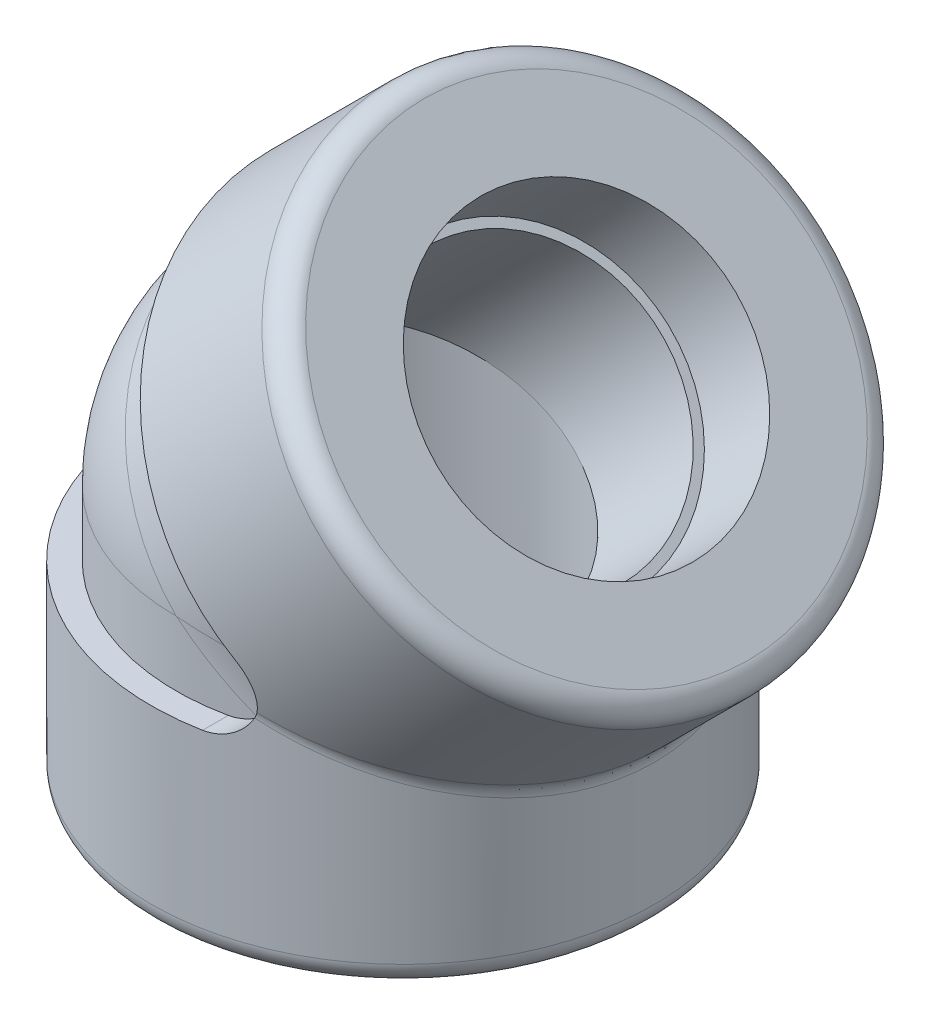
ISO-10303-21;
HEADER;
FILE_DESCRIPTION(('STEP AP214'),'2;1');
FILE_NAME('part.step','',(''),(''),'','','');
FILE_SCHEMA(('AUTOMOTIVE_DESIGN { 1 0 10303 214 1 1 1 1 }'));
ENDSEC;
DATA;
#1=APPLICATION_CONTEXT('core data for automotive mechanical design processes');
#2=APPLICATION_PROTOCOL_DEFINITION('international standard','automotive_design',2000,#1);
#3=PRODUCT_CONTEXT('',#1,'mechanical');
#4=PRODUCT('Part','Part','',(#3));
#5=PRODUCT_RELATED_PRODUCT_CATEGORY('part','',(#4));
#6=PRODUCT_DEFINITION_FORMATION('','',#4);
#7=PRODUCT_DEFINITION_CONTEXT('part definition',#1,'design');
#8=PRODUCT_DEFINITION('design','',#6,#7);
#9=PRODUCT_DEFINITION_SHAPE('','',#8);
#10=(LENGTH_UNIT() NAMED_UNIT(*) SI_UNIT(.MILLI.,.METRE.));
#11=(NAMED_UNIT(*) PLANE_ANGLE_UNIT() SI_UNIT($,.RADIAN.));
#12=(NAMED_UNIT(*) SI_UNIT($,.STERADIAN.) SOLID_ANGLE_UNIT());
#13=UNCERTAINTY_MEASURE_WITH_UNIT(LENGTH_MEASURE(1.E-05),#10,'distance_accuracy_value','');
#14=(GEOMETRIC_REPRESENTATION_CONTEXT(3) GLOBAL_UNCERTAINTY_ASSIGNED_CONTEXT((#13)) GLOBAL_UNIT_ASSIGNED_CONTEXT((#10,
#11,#12)) REPRESENTATION_CONTEXT('',''));
#15=CARTESIAN_POINT('',(0.,0.,0.));
#16=DIRECTION('',(0.,0.,1.));
#17=DIRECTION('',(1.,0.,0.));
#18=AXIS2_PLACEMENT_3D('',#15,#16,#17);
#19=CARTESIAN_POINT('',(0.,0.,45.72));
#20=CARTESIAN_POINT('',(0.,0.,45.72));
#21=CARTESIAN_POINT('',(0.,0.,45.72));
#22=CARTESIAN_POINT('',(1.28904200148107,-0.120958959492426,45.7200212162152));
#23=CARTESIAN_POINT('',(1.14306044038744,-0.473471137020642,45.7201887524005));
#24=CARTESIAN_POINT('',(0.997021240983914,-0.825959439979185,45.7200212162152));
#25=CARTESIAN_POINT('',(2.57809056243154,-0.241918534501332,45.6873874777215));
#26=CARTESIAN_POINT('',(2.286314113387,-0.94702231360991,45.6778364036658));
#27=CARTESIAN_POINT('',(1.994047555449,-1.65192308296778,45.6873874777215));
#28=CARTESIAN_POINT('',(5.1515141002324,-0.483399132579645,45.5569588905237));
#29=CARTESIAN_POINT('',(4.56503356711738,-1.89089881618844,45.5093171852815));
#30=CARTESIAN_POINT('',(3.98448535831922,-3.30085574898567,45.5569588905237));
#31=CARTESIAN_POINT('',(6.43588893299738,-0.603920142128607,45.4591620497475));
#32=CARTESIAN_POINT('',(5.70096880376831,-2.36141859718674,45.3830777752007));
#33=CARTESIAN_POINT('',(4.9778967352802,-4.1238246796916,45.4591620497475));
#34=CARTESIAN_POINT('',(8.9920228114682,-0.843778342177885,45.1988794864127));
#35=CARTESIAN_POINT('',(7.95488437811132,-3.29502099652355,45.0481588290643));
#36=CARTESIAN_POINT('',(6.95496169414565,-5.76167891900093,45.1988794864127));
#37=CARTESIAN_POINT('',(10.2638052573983,-0.963117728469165,45.0365549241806));
#38=CARTESIAN_POINT('',(9.07335051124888,-3.75830483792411,44.8395478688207));
#39=CARTESIAN_POINT('',(7.93863337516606,-6.57657922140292,45.0365549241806));
#40=CARTESIAN_POINT('',(12.7932331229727,-1.20046993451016,44.6475217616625));
#41=CARTESIAN_POINT('',(11.2880995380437,-4.67568392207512,44.3418457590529));
#42=CARTESIAN_POINT('',(9.89504232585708,-8.19732146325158,44.6475217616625));
#43=CARTESIAN_POINT('',(14.0508787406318,-1.31848277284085,44.4208140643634));
#44=CARTESIAN_POINT('',(12.3847917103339,-5.12994869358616,44.0525586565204));
#45=CARTESIAN_POINT('',(10.8677797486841,-9.00316352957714,44.4208140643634));
#46=CARTESIAN_POINT('',(16.5411653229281,-1.55216210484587,43.904708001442));
#47=CARTESIAN_POINT('',(14.5438068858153,-6.02424206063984,43.3977244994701));
#48=CARTESIAN_POINT('',(12.7939145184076,-10.5988258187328,43.904708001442));
#49=CARTESIAN_POINT('',(17.7738984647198,-1.66783724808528,43.6156214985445));
#50=CARTESIAN_POINT('',(15.6066358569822,-6.46448023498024,43.0323080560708));
#51=CARTESIAN_POINT('',(13.7473831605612,-11.3887051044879,43.6156214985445));
#52=CARTESIAN_POINT('',(20.2160923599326,-1.89700373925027,42.9746295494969));
#53=CARTESIAN_POINT('',(17.6971735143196,-7.33040928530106,42.2275925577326));
#54=CARTESIAN_POINT('',(15.6363202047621,-12.9535517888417,42.9746295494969));
#55=CARTESIAN_POINT('',(21.4255490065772,-2.01049470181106,42.6227131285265));
#56=CARTESIAN_POINT('',(18.7251714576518,-7.7562199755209,41.7879939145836));
#57=CARTESIAN_POINT('',(16.5717854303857,-13.7285165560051,42.6227131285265));
#58=CARTESIAN_POINT('',(23.8078062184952,-2.23403695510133,41.8594921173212));
#59=CARTESIAN_POINT('',(20.7326562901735,-8.58774741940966,40.84224786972));
#60=CARTESIAN_POINT('',(18.4143639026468,-15.2549585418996,41.8594921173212));
#61=CARTESIAN_POINT('',(24.9808030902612,-2.34410666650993,41.4486171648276));
#62=CARTESIAN_POINT('',(21.7126702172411,-8.99368247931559,40.3362672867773));
#63=CARTESIAN_POINT('',(19.3216289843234,-16.0065615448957,41.4486171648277));
#64=CARTESIAN_POINT('',(27.2939940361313,-2.56116799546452,40.5665844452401));
#65=CARTESIAN_POINT('',(23.6261459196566,-9.78627006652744,39.2599703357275));
#66=CARTESIAN_POINT('',(21.1107875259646,-17.4887490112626,40.5665844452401));
#67=CARTESIAN_POINT('',(28.4341888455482,-2.66815968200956,40.0954280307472));
#68=CARTESIAN_POINT('',(24.5597585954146,-10.1729850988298,38.6893343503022));
#69=CARTESIAN_POINT('',(21.9926815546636,-18.2193339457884,40.0954280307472));
#70=CARTESIAN_POINT('',(30.6674450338,-2.87772022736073,39.0981522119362));
#71=CARTESIAN_POINT('',(26.3676838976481,-10.9218522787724,37.4939336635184));
#72=CARTESIAN_POINT('',(23.7200138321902,-19.6503028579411,39.0981522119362));
#73=CARTESIAN_POINT('',(31.7608224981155,-2.98031874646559,38.5725291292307));
#74=CARTESIAN_POINT('',(27.2425230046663,-11.2842225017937,36.8693393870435));
#75=CARTESIAN_POINT('',(24.565696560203,-20.3508893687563,38.5725291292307));
#76=CARTESIAN_POINT('',(33.9054424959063,-3.18156199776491,37.4645167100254));
#77=CARTESIAN_POINT('',(28.9368858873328,-11.9860505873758,35.5676142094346));
#78=CARTESIAN_POINT('',(26.224472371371,-21.7250642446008,37.4645167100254));
#79=CARTESIAN_POINT('',(34.95669414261,-3.28020758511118,36.8821397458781));
#80=CARTESIAN_POINT('',(29.7564185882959,-12.3255121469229,34.8902025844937));
#81=CARTESIAN_POINT('',(27.0375725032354,-22.3986584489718,36.8821397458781));
#82=CARTESIAN_POINT('',(37.0025426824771,-3.47218248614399,35.6679366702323));
#83=CARTESIAN_POINT('',(31.3290917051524,-12.9769346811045,33.495433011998));
#84=CARTESIAN_POINT('',(28.6199526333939,-23.7095450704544,35.6679366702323));
#85=CARTESIAN_POINT('',(37.9975860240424,-3.56555369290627,35.0366380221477));
#86=CARTESIAN_POINT('',(32.0827435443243,-13.2891074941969,32.7782469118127));
#87=CARTESIAN_POINT('',(29.3895779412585,-24.3471235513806,35.0366380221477));
#88=CARTESIAN_POINT('',(39.9369566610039,-3.74753709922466,33.7215912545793));
#89=CARTESIAN_POINT('',(33.5295496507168,-13.8883942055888,31.3041838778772));
#90=CARTESIAN_POINT('',(30.8896017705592,-25.589783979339,33.7215912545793));
#91=CARTESIAN_POINT('',(40.8812843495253,-3.83614933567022,33.0378435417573));
#92=CARTESIAN_POINT('',(34.2225666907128,-14.1754512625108,30.5471036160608));
#93=CARTESIAN_POINT('',(31.6200005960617,-26.194866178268,33.0378435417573));
#94=CARTESIAN_POINT('',(42.7050269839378,-4.00728263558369,31.6272531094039));
#95=CARTESIAN_POINT('',(35.5393009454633,-14.7208604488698,29.0074787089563));
#96=CARTESIAN_POINT('',(33.0305908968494,-27.3634374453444,31.627253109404));
#97=CARTESIAN_POINT('',(43.5850071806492,-4.08985674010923,30.9009228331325));
#98=CARTESIAN_POINT('',(36.163489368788,-14.9794077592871,28.225106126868));
#99=CARTESIAN_POINT('',(33.7112195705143,-27.9272887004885,30.9009228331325));
#100=CARTESIAN_POINT('',(45.285918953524,-4.24946404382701,29.4012955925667));
#101=CARTESIAN_POINT('',(37.3495211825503,-15.4706782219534,26.6337301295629));
#102=CARTESIAN_POINT('',(35.0268052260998,-29.0171555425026,29.4012955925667));
#103=CARTESIAN_POINT('',(46.1068510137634,-4.32649728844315,28.6279990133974));
#104=CARTESIAN_POINT('',(37.9111351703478,-15.7033063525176,25.8246532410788));
#105=CARTESIAN_POINT('',(35.6617625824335,-29.5431714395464,28.6279990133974));
#106=CARTESIAN_POINT('',(47.6771323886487,-4.4738467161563,27.0451685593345));
#107=CARTESIAN_POINT('',(38.9663881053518,-16.1404064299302,24.1940934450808));
#108=CARTESIAN_POINT('',(36.8763109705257,-30.5493362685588,27.0451685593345));
#109=CARTESIAN_POINT('',(48.4271201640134,-4.5442228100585,26.2360788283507));
#110=CARTESIAN_POINT('',(39.4604199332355,-16.3450411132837,23.3727893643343));
#111=CARTESIAN_POINT('',(37.4563958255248,-31.0298942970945,26.2360788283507));
#112=CARTESIAN_POINT('',(49.8604355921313,-4.67871985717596,24.577501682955));
#113=CARTESIAN_POINT('',(40.3876719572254,-16.7291214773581,21.7152971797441));
#114=CARTESIAN_POINT('',(38.5650066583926,-31.9482975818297,24.577501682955));
#115=CARTESIAN_POINT('',(50.5437637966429,-4.74284086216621,23.728014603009));
#116=CARTESIAN_POINT('',(40.8206245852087,-16.9084563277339,20.8791811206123));
#117=CARTESIAN_POINT('',(39.0935330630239,-32.3861431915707,23.728014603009));
#118=CARTESIAN_POINT('',(51.8336505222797,-4.86387908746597,21.9999912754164));
#119=CARTESIAN_POINT('',(41.6232515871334,-17.240915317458,19.204711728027));
#120=CARTESIAN_POINT('',(40.0912076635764,-33.2126438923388,21.9999912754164));
#121=CARTESIAN_POINT('',(52.4408589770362,-4.92085729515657,21.1217952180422));
#122=CARTESIAN_POINT('',(41.9932196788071,-17.3941611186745,18.3665671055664));
#123=CARTESIAN_POINT('',(40.5608585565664,-33.6017154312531,21.1217952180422));
#124=CARTESIAN_POINT('',(53.5820057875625,-5.02793831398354,19.3326309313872));
#125=CARTESIAN_POINT('',(42.6765142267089,-17.677190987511,16.6844814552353));
#126=CARTESIAN_POINT('',(41.4434889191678,-34.3329103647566,19.3326309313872));
#127=CARTESIAN_POINT('',(54.1159447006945,-5.07804117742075,18.4216629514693));
#128=CARTESIAN_POINT('',(42.9895874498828,-17.8068701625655,15.8407463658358));
#129=CARTESIAN_POINT('',(41.8564688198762,-34.6750341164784,18.4216629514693));
#130=CARTESIAN_POINT('',(55.1032868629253,-5.17068973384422,16.5780031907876));
#131=CARTESIAN_POINT('',(43.5591296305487,-18.0427822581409,14.1571907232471));
#132=CARTESIAN_POINT('',(42.6201375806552,-35.307678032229,16.5780031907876));
#133=CARTESIAN_POINT('',(55.5572760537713,-5.21329040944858,15.6455314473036));
#134=CARTESIAN_POINT('',(43.8157906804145,-18.1490947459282,13.3176333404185));
#135=CARTESIAN_POINT('',(42.9712796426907,-35.5985736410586,15.6455314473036));
#136=CARTESIAN_POINT('',(56.3866747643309,-5.29111813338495,13.7563944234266));
#137=CARTESIAN_POINT('',(44.2779314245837,-18.3405197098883,11.6382329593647));
#138=CARTESIAN_POINT('',(43.6127856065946,-36.1300145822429,13.7563944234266));
#139=CARTESIAN_POINT('',(56.7620847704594,-5.32634522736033,12.7997292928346));
#140=CARTESIAN_POINT('',(44.4832114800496,-18.425549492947,10.7986984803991));
#141=CARTESIAN_POINT('',(43.9031498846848,-36.3705602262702,12.7997292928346));
#142=CARTESIAN_POINT('',(57.4299080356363,-5.38901130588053,10.8719979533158));
#143=CARTESIAN_POINT('',(44.8439796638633,-18.5749845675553,9.12531458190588));
#144=CARTESIAN_POINT('',(44.4196838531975,-36.7984709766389,10.8719979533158));
#145=CARTESIAN_POINT('',(57.7227662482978,-5.41649204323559,9.90103983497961));
#146=CARTESIAN_POINT('',(44.9995739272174,-18.6394338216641,8.29179468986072));
#147=CARTESIAN_POINT('',(44.6461976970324,-36.9861211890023,9.90103983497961));
#148=CARTESIAN_POINT('',(58.2261752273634,-5.46373008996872,7.94427409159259));
#149=CARTESIAN_POINT('',(45.2646136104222,-18.7492168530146,6.62629599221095));
#150=CARTESIAN_POINT('',(45.0355639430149,-37.3086827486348,7.94427409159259));
#151=CARTESIAN_POINT('',(58.4367263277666,-5.48348743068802,6.95846652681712));
#152=CARTESIAN_POINT('',(45.3739344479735,-18.7944990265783,5.79468999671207));
#153=CARTESIAN_POINT('',(45.1984166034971,-37.4435943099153,6.95846652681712));
#154=CARTESIAN_POINT('',(58.7735380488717,-5.51509260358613,4.97969562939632));
#155=CARTESIAN_POINT('',(45.5478468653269,-18.8665359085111,4.13518945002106));
#156=CARTESIAN_POINT('',(45.4589266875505,-37.659407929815,4.97969562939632));
#157=CARTESIAN_POINT('',(58.9000391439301,-5.52696300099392,3.98676099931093));
#158=CARTESIAN_POINT('',(45.6124827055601,-18.8933089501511,3.30767958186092));
#159=CARTESIAN_POINT('',(45.5567701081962,-37.7404640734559,3.98676099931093));
#160=CARTESIAN_POINT('',(59.0688090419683,-5.54279974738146,1.99588424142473));
#161=CARTESIAN_POINT('',(45.6985802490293,-18.9289717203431,1.65324602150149));
#162=CARTESIAN_POINT('',(45.6873067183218,-37.8486041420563,1.99588424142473));
#163=CARTESIAN_POINT('',(59.1110779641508,-5.54676610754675,0.997942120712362));
#164=CARTESIAN_POINT('',(45.72,-18.9378440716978,0.826724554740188));
#165=CARTESIAN_POINT('',(45.72,-37.8756881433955,0.997942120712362));
#166=CARTESIAN_POINT('',(59.1110779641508,-5.54676610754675,-0.997942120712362));
#167=CARTESIAN_POINT('',(45.72,-18.9378440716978,-0.826724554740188));
#168=CARTESIAN_POINT('',(45.72,-37.8756881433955,-0.997942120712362));
#169=CARTESIAN_POINT('',(59.0688090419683,-5.54279974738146,-1.99588424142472));
#170=CARTESIAN_POINT('',(45.6985802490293,-18.9289717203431,-1.65324602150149));
#171=CARTESIAN_POINT('',(45.6873067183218,-37.8486041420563,-1.99588424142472));
#172=CARTESIAN_POINT('',(58.9000391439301,-5.52696300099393,-3.98676099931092));
#173=CARTESIAN_POINT('',(45.6124827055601,-18.8933089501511,-3.30767958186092));
#174=CARTESIAN_POINT('',(45.5567701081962,-37.7404640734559,-3.98676099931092));
#175=CARTESIAN_POINT('',(58.7735380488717,-5.51509260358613,-4.97969562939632));
#176=CARTESIAN_POINT('',(45.5478468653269,-18.8665359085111,-4.13518945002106));
#177=CARTESIAN_POINT('',(45.4589266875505,-37.659407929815,-4.97969562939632));
#178=CARTESIAN_POINT('',(58.4367263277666,-5.48348743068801,-6.95846652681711));
#179=CARTESIAN_POINT('',(45.3739344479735,-18.7944990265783,-5.79468999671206));
#180=CARTESIAN_POINT('',(45.1984166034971,-37.4435943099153,-6.95846652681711));
#181=CARTESIAN_POINT('',(58.2261752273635,-5.4637300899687,-7.94427409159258));
#182=CARTESIAN_POINT('',(45.2646136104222,-18.7492168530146,-6.62629599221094));
#183=CARTESIAN_POINT('',(45.0355639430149,-37.3086827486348,-7.94427409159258));
#184=CARTESIAN_POINT('',(57.7227662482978,-5.41649204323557,-9.90103983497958));
#185=CARTESIAN_POINT('',(44.9995739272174,-18.6394338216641,-8.29179468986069));
#186=CARTESIAN_POINT('',(44.6461976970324,-36.9861211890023,-9.90103983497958));
#187=CARTESIAN_POINT('',(57.4299080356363,-5.38901130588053,-10.8719979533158));
#188=CARTESIAN_POINT('',(44.8439796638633,-18.5749845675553,-9.12531458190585));
#189=CARTESIAN_POINT('',(44.4196838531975,-36.7984709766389,-10.8719979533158));
#190=CARTESIAN_POINT('',(56.7620847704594,-5.32634522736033,-12.7997292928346));
#191=CARTESIAN_POINT('',(44.4832114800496,-18.425549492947,-10.7986984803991));
#192=CARTESIAN_POINT('',(43.9031498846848,-36.3705602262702,-12.7997292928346));
#193=CARTESIAN_POINT('',(56.3866747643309,-5.29111813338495,-13.7563944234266));
#194=CARTESIAN_POINT('',(44.2779314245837,-18.3405197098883,-11.6382329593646));
#195=CARTESIAN_POINT('',(43.6127856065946,-36.130014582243,-13.7563944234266));
#196=CARTESIAN_POINT('',(55.5572760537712,-5.21329040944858,-15.6455314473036));
#197=CARTESIAN_POINT('',(43.8157906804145,-18.1490947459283,-13.3176333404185));
#198=CARTESIAN_POINT('',(42.9712796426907,-35.5985736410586,-15.6455314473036));
#199=CARTESIAN_POINT('',(55.1032868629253,-5.17068973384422,-16.5780031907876));
#200=CARTESIAN_POINT('',(43.5591296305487,-18.0427822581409,-14.1571907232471));
#201=CARTESIAN_POINT('',(42.6201375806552,-35.307678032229,-16.5780031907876));
#202=CARTESIAN_POINT('',(54.1159447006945,-5.07804117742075,-18.4216629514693));
#203=CARTESIAN_POINT('',(42.9895874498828,-17.8068701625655,-15.8407463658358));
#204=CARTESIAN_POINT('',(41.8564688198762,-34.6750341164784,-18.4216629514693));
#205=CARTESIAN_POINT('',(53.5820057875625,-5.02793831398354,-19.3326309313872));
#206=CARTESIAN_POINT('',(42.6765142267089,-17.6771909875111,-16.6844814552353));
#207=CARTESIAN_POINT('',(41.4434889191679,-34.3329103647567,-19.3326309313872));
#208=CARTESIAN_POINT('',(52.4408589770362,-4.92085729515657,-21.1217952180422));
#209=CARTESIAN_POINT('',(41.9932196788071,-17.3941611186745,-18.3665671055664));
#210=CARTESIAN_POINT('',(40.5608585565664,-33.6017154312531,-21.1217952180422));
#211=CARTESIAN_POINT('',(51.8336505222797,-4.86387908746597,-21.9999912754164));
#212=CARTESIAN_POINT('',(41.6232515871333,-17.240915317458,-19.204711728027));
#213=CARTESIAN_POINT('',(40.0912076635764,-33.2126438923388,-21.9999912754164));
#214=CARTESIAN_POINT('',(50.543763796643,-4.74284086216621,-23.728014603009));
#215=CARTESIAN_POINT('',(40.8206245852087,-16.9084563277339,-20.8791811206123));
#216=CARTESIAN_POINT('',(39.0935330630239,-32.3861431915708,-23.728014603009));
#217=CARTESIAN_POINT('',(49.8604355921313,-4.67871985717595,-24.577501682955));
#218=CARTESIAN_POINT('',(40.3876719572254,-16.7291214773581,-21.7152971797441));
#219=CARTESIAN_POINT('',(38.5650066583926,-31.9482975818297,-24.577501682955));
#220=CARTESIAN_POINT('',(48.4271201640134,-4.5442228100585,-26.2360788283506));
#221=CARTESIAN_POINT('',(39.4604199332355,-16.3450411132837,-23.3727893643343));
#222=CARTESIAN_POINT('',(37.4563958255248,-31.0298942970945,-26.2360788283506));
#223=CARTESIAN_POINT('',(47.6771323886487,-4.47384671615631,-27.0451685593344));
#224=CARTESIAN_POINT('',(38.9663881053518,-16.1404064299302,-24.1940934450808));
#225=CARTESIAN_POINT('',(36.8763109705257,-30.5493362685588,-27.0451685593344));
#226=CARTESIAN_POINT('',(46.1068510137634,-4.32649728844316,-28.6279990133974));
#227=CARTESIAN_POINT('',(37.9111351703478,-15.7033063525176,-25.8246532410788));
#228=CARTESIAN_POINT('',(35.6617625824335,-29.5431714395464,-28.6279990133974));
#229=CARTESIAN_POINT('',(45.285918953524,-4.24946404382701,-29.4012955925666));
#230=CARTESIAN_POINT('',(37.3495211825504,-15.4706782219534,-26.6337301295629));
#231=CARTESIAN_POINT('',(35.0268052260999,-29.0171555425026,-29.4012955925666));
#232=CARTESIAN_POINT('',(43.5850071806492,-4.08985674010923,-30.9009228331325));
#233=CARTESIAN_POINT('',(36.163489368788,-14.9794077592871,-28.225106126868));
#234=CARTESIAN_POINT('',(33.7112195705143,-27.9272887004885,-30.9009228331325));
#235=CARTESIAN_POINT('',(42.7050269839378,-4.00728263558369,-31.6272531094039));
#236=CARTESIAN_POINT('',(35.5393009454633,-14.7208604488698,-29.0074787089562));
#237=CARTESIAN_POINT('',(33.0305908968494,-27.3634374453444,-31.6272531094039));
#238=CARTESIAN_POINT('',(40.8812843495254,-3.83614933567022,-33.0378435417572));
#239=CARTESIAN_POINT('',(34.2225666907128,-14.1754512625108,-30.5471036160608));
#240=CARTESIAN_POINT('',(31.6200005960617,-26.194866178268,-33.0378435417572));
#241=CARTESIAN_POINT('',(39.9369566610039,-3.74753709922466,-33.7215912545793));
#242=CARTESIAN_POINT('',(33.5295496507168,-13.8883942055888,-31.3041838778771));
#243=CARTESIAN_POINT('',(30.8896017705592,-25.589783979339,-33.7215912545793));
#244=CARTESIAN_POINT('',(37.9975860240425,-3.56555369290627,-35.0366380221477));
#245=CARTESIAN_POINT('',(32.0827435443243,-13.2891074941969,-32.7782469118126));
#246=CARTESIAN_POINT('',(29.3895779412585,-24.3471235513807,-35.0366380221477));
#247=CARTESIAN_POINT('',(37.0025426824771,-3.472182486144,-35.6679366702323));
#248=CARTESIAN_POINT('',(31.3290917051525,-12.9769346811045,-33.4954330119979));
#249=CARTESIAN_POINT('',(28.6199526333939,-23.7095450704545,-35.6679366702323));
#250=CARTESIAN_POINT('',(34.9566941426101,-3.28020758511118,-36.8821397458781));
#251=CARTESIAN_POINT('',(29.7564185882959,-12.3255121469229,-34.8902025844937));
#252=CARTESIAN_POINT('',(27.0375725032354,-22.3986584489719,-36.8821397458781));
#253=CARTESIAN_POINT('',(33.9054424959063,-3.18156199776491,-37.4645167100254));
#254=CARTESIAN_POINT('',(28.9368858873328,-11.9860505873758,-35.5676142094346));
#255=CARTESIAN_POINT('',(26.224472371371,-21.7250642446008,-37.4645167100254));
#256=CARTESIAN_POINT('',(31.7608224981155,-2.9803187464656,-38.5725291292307));
#257=CARTESIAN_POINT('',(27.2425230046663,-11.2842225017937,-36.8693393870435));
#258=CARTESIAN_POINT('',(24.565696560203,-20.3508893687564,-38.5725291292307));
#259=CARTESIAN_POINT('',(30.6674450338,-2.87772022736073,-39.0981522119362));
#260=CARTESIAN_POINT('',(26.3676838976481,-10.9218522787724,-37.4939336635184));
#261=CARTESIAN_POINT('',(23.7200138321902,-19.6503028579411,-39.0981522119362));
#262=CARTESIAN_POINT('',(28.4341888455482,-2.66815968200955,-40.0954280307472));
#263=CARTESIAN_POINT('',(24.5597585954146,-10.1729850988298,-38.6893343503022));
#264=CARTESIAN_POINT('',(21.9926815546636,-18.2193339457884,-40.0954280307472));
#265=CARTESIAN_POINT('',(27.2939940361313,-2.5611679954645,-40.5665844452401));
#266=CARTESIAN_POINT('',(23.6261459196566,-9.78627006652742,-39.2599703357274));
#267=CARTESIAN_POINT('',(21.1107875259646,-17.4887490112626,-40.5665844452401));
#268=CARTESIAN_POINT('',(24.9808030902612,-2.34410666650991,-41.4486171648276));
#269=CARTESIAN_POINT('',(21.7126702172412,-8.99368247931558,-40.3362672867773));
#270=CARTESIAN_POINT('',(19.3216289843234,-16.0065615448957,-41.4486171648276));
#271=CARTESIAN_POINT('',(23.8078062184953,-2.23403695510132,-41.8594921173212));
#272=CARTESIAN_POINT('',(20.7326562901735,-8.58774741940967,-40.84224786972));
#273=CARTESIAN_POINT('',(18.4143639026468,-15.2549585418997,-41.8594921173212));
#274=CARTESIAN_POINT('',(21.4255490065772,-2.01049470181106,-42.6227131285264));
#275=CARTESIAN_POINT('',(18.7251714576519,-7.75621997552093,-41.7879939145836));
#276=CARTESIAN_POINT('',(16.5717854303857,-13.7285165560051,-42.6227131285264));
#277=CARTESIAN_POINT('',(20.2160923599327,-1.89700373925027,-42.9746295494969));
#278=CARTESIAN_POINT('',(17.6971735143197,-7.33040928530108,-42.2275925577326));
#279=CARTESIAN_POINT('',(15.6363202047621,-12.9535517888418,-42.9746295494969));
#280=CARTESIAN_POINT('',(17.7738984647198,-1.66783724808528,-43.6156214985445));
#281=CARTESIAN_POINT('',(15.6066358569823,-6.46448023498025,-43.0323080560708));
#282=CARTESIAN_POINT('',(13.7473831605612,-11.3887051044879,-43.6156214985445));
#283=CARTESIAN_POINT('',(16.5411653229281,-1.55216210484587,-43.904708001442));
#284=CARTESIAN_POINT('',(14.5438068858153,-6.02424206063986,-43.3977244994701));
#285=CARTESIAN_POINT('',(12.7939145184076,-10.5988258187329,-43.904708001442));
#286=CARTESIAN_POINT('',(14.0508787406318,-1.31848277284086,-44.4208140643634));
#287=CARTESIAN_POINT('',(12.384791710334,-5.12994869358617,-44.0525586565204));
#288=CARTESIAN_POINT('',(10.8677797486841,-9.00316352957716,-44.4208140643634));
#289=CARTESIAN_POINT('',(12.7932331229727,-1.20046993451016,-44.6475217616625));
#290=CARTESIAN_POINT('',(11.2880995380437,-4.67568392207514,-44.3418457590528));
#291=CARTESIAN_POINT('',(9.89504232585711,-8.1973214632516,-44.6475217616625));
#292=CARTESIAN_POINT('',(10.2638052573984,-0.963117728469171,-45.0365549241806));
#293=CARTESIAN_POINT('',(9.07335051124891,-3.75830483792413,-44.8395478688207));
#294=CARTESIAN_POINT('',(7.93863337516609,-6.57657922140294,-45.0365549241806));
#295=CARTESIAN_POINT('',(8.99202281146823,-0.84377834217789,-45.1988794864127));
#296=CARTESIAN_POINT('',(7.95488437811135,-3.29502099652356,-45.0481588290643));
#297=CARTESIAN_POINT('',(6.95496169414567,-5.76167891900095,-45.1988794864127));
#298=CARTESIAN_POINT('',(6.43588893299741,-0.603920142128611,-45.4591620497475));
#299=CARTESIAN_POINT('',(5.70096880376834,-2.36141859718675,-45.3830777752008));
#300=CARTESIAN_POINT('',(4.97789673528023,-4.12382467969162,-45.4591620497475));
#301=CARTESIAN_POINT('',(5.15151410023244,-0.483399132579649,-45.5569588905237));
#302=CARTESIAN_POINT('',(4.56503356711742,-1.89089881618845,-45.5093171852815));
#303=CARTESIAN_POINT('',(3.98448535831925,-3.30085574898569,-45.5569588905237));
#304=CARTESIAN_POINT('',(2.57809056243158,-0.241918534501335,-45.6873874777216));
#305=CARTESIAN_POINT('',(2.28631411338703,-0.947022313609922,-45.6778364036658));
#306=CARTESIAN_POINT('',(1.99404755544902,-1.6519230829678,-45.6873874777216));
#307=CARTESIAN_POINT('',(1.2890420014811,-0.120958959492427,-45.7200212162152));
#308=CARTESIAN_POINT('',(1.14306044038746,-0.473471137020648,-45.7201887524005));
#309=CARTESIAN_POINT('',(0.997021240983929,-0.825959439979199,-45.7200212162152));
#310=CARTESIAN_POINT('',(0.,0.,-45.72));
#311=CARTESIAN_POINT('',(0.,0.,-45.72));
#312=CARTESIAN_POINT('',(0.,0.,-45.72));
#313=(BOUNDED_SURFACE() B_SPLINE_SURFACE(3,2,((#19,#20,#21),(#22,#23,#24),(#25,#26,#27),(#28,
#29,#30),(#31,#32,#33),(#34,#35,#36),(#37,#38,#39),(#40,#41,#42),(#43,#44,#45),(#46,#47,#48),
(#49,#50,#51),(#52,#53,#54),(#55,#56,#57),(#58,#59,#60),(#61,#62,#63),(#64,#65,#66),(#67,#68,
#69),(#70,#71,#72),(#73,#74,#75),(#76,#77,#78),(#79,#80,#81),(#82,#83,#84),(#85,#86,#87),(#88,
#89,#90),(#91,#92,#93),(#94,#95,#96),(#97,#98,#99),(#100,#101,#102),(#103,#104,#105),(#106,#107,
#108),(#109,#110,#111),(#112,#113,#114),(#115,#116,#117),(#118,#119,#120),(#121,#122,#123),
(#124,#125,#126),(#127,#128,#129),(#130,#131,#132),(#133,#134,#135),(#136,#137,#138),(#139,#140,
#141),(#142,#143,#144),(#145,#146,#147),(#148,#149,#150),(#151,#152,#153),(#154,#155,#156),
(#157,#158,#159),(#160,#161,#162),(#163,#164,#165),(#166,#167,#168),(#169,#170,#171),(#172,#173,
#174),(#175,#176,#177),(#178,#179,#180),(#181,#182,#183),(#184,#185,#186),(#187,#188,#189),
(#190,#191,#192),(#193,#194,#195),(#196,#197,#198),(#199,#200,#201),(#202,#203,#204),(#205,#206,
#207),(#208,#209,#210),(#211,#212,#213),(#214,#215,#216),(#217,#218,#219),(#220,#221,#222),
(#223,#224,#225),(#226,#227,#228),(#229,#230,#231),(#232,#233,#234),(#235,#236,#237),(#238,#239,
#240),(#241,#242,#243),(#244,#245,#246),(#247,#248,#249),(#250,#251,#252),(#253,#254,#255),
(#256,#257,#258),(#259,#260,#261),(#262,#263,#264),(#265,#266,#267),(#268,#269,#270),(#271,#272,
#273),(#274,#275,#276),(#277,#278,#279),(#280,#281,#282),(#283,#284,#285),(#286,#287,#288),
(#289,#290,#291),(#292,#293,#294),(#295,#296,#297),(#298,#299,#300),(#301,#302,#303),(#304,#305,
#306),(#307,#308,#309),(#310,#311,#312)),.UNSPECIFIED.,.F.,.F.,
.F.) B_SPLINE_SURFACE_WITH_KNOTS((4,2,2,2,2,2,2,2,2,2,2,2,2,2,2,2,2,2,2,2,2,2,2,2,2,2,2,2,2,2,2,
2,2,2,2,2,2,2,2,2,2,2,2,2,2,2,2,2,4),(3,3),(0.,6.47404152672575,12.9482809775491,
19.4064513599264,25.8645311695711,32.2910424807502,38.7186774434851,45.1016511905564,
51.4844817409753,57.8135556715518,64.1412529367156,70.4083003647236,76.6752992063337,
82.8781838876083,89.0810177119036,95.2212910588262,101.361513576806,107.445103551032,
113.528647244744,119.565560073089,125.602435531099,131.606121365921,137.609782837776,
143.596192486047,149.582593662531,155.568994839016,161.555404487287,167.559065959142,
173.562751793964,179.599627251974,185.636540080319,191.720083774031,197.803673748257,
203.943896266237,210.084169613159,216.287003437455,222.489888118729,228.756886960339,
235.023934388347,241.351631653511,247.680705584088,254.063536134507,260.446509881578,
266.874144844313,273.300656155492,279.758735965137,286.216906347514,292.691145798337,
299.165187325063),(0.,1.),
.UNSPECIFIED.) GEOMETRIC_REPRESENTATION_ITEM() RATIONAL_B_SPLINE_SURFACE(((1.,1.,1.),(1.,
1.00000047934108,1.),(1.,0.999895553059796,1.),(1.,0.999478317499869,1.),(1.,0.999166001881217,
1.),(1.,0.998338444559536,1.),(1.,0.997823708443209,1.),(1.,0.996598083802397,1.),(1.,
0.995887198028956,1.),(1.,0.994282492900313,1.),(1.,0.993389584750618,1.),(1.,0.991430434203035,
1.),(1.,0.990364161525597,1.),(1.,0.988080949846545,1.),(1.,0.986865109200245,1.),(1.,
0.984293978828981,1.),(1.,0.982938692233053,1.),(1.,0.980120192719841,1.),(1.,0.978657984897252,
1.),(1.,0.975637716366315,1.),(1.,0.974079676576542,1.),(1.,0.970906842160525,1.),(1.,
0.96929273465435,1.),(1.,0.966019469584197,1.),(1.,0.964360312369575,1.),(1.,0.961041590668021,
1.),(1.,0.959382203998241,1.),(1.,0.956074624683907,1.),(1.,0.954426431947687,1.),(1.,
0.951187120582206,1.),(1.,0.949595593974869,1.),(1.,0.946481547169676,1.),(1.,0.944959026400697,
1.),(1.,0.942025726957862,1.),(1.,0.940614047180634,1.),(1.,0.937914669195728,1.),(1.,
0.93662697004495,1.),(1.,0.934211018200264,1.),(1.,0.933081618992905,1.),(1.,0.930994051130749,
1.),(1.,0.930035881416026,1.),(1.,0.928315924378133,1.),(1.,0.927553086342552,1.),(1.,
0.926233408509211,1.),(1.,0.925676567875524,1.),(1.,0.924782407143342,1.),(1.,0.92444446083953,
1.),(1.,0.923993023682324,1.),(1.,0.923879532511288,1.),(1.,0.923879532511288,1.),(1.,
0.923993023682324,1.),(1.,0.92444446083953,1.),(1.,0.924782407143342,1.),(1.,0.925676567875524,
1.),(1.,0.926233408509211,1.),(1.,0.927553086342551,1.),(1.,0.928315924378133,1.),(1.,
0.930035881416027,1.),(1.,0.930994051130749,1.),(1.,0.933081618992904,1.),(1.,0.934211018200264,
1.),(1.,0.93662697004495,1.),(1.,0.937914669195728,1.),(1.,0.940614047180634,1.),(1.,
0.942025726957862,1.),(1.,0.944959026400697,1.),(1.,0.946481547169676,1.),(1.,0.949595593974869,
1.),(1.,0.951187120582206,1.),(1.,0.954426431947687,1.),(1.,0.956074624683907,1.),(1.,
0.959382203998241,1.),(1.,0.961041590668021,1.),(1.,0.964360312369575,1.),(1.,0.966019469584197,
1.),(1.,0.96929273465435,1.),(1.,0.970906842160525,1.),(1.,0.974079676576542,1.),(1.,
0.975637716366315,1.),(1.,0.978657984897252,1.),(1.,0.980120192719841,1.),(1.,0.982938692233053,
1.),(1.,0.984293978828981,1.),(1.,0.986865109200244,1.),(1.,0.988080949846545,1.),(1.,
0.990364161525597,1.),(1.,0.991430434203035,1.),(1.,0.993389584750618,1.),(1.,0.994282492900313,
1.),(1.,0.995887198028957,1.),(1.,0.996598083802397,1.),(1.,0.997823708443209,1.),(1.,
0.998338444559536,1.),(1.,0.999166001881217,1.),(1.,0.999478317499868,1.),(1.,0.999895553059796,
1.),(1.,1.00000047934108,1.),(1.,1.,1.))) REPRESENTATION_ITEM('') SURFACE());
#314=CARTESIAN_POINT('',(0.,0.,0.));
#315=DIRECTION('',(-0.637951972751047,-0.770076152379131,0.));
#316=DIRECTION('',(0.770076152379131,-0.637951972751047,0.));
#317=AXIS2_PLACEMENT_3D('',#314,#315,#316);
#318=ELLIPSE('',#317,59.3707516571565,45.72);
#319=CARTESIAN_POINT('',(14.2138845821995,-11.7751675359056,43.454388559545));
#320=VERTEX_POINT('',#319);
#321=CARTESIAN_POINT('',(0.,0.,45.72));
#322=VERTEX_POINT('',#321);
#323=EDGE_CURVE('E131',#320,#322,#318,.T.);
#324=ORIENTED_EDGE('',*,*,#323,.F.);
#325=CARTESIAN_POINT('',(14.2138845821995,-11.7751675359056,43.454388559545));
#326=CARTESIAN_POINT('',(14.4170349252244,-11.6531291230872,43.3879328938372));
#327=CARTESIAN_POINT('',(14.6159574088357,-11.5228561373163,43.3235144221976));
#328=CARTESIAN_POINT('',(15.0042069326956,-11.2462813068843,43.1999123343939));
#329=CARTESIAN_POINT('',(15.1935288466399,-11.099971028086,43.1407315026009));
#330=CARTESIAN_POINT('',(15.5618629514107,-10.7913533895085,43.0286423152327));
#331=CARTESIAN_POINT('',(15.7408367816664,-10.6289918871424,42.9757566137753));
#332=CARTESIAN_POINT('',(16.0863766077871,-10.2894559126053,42.8776776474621));
#333=CARTESIAN_POINT('',(16.2529446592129,-10.112283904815,42.8324831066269));
#334=CARTESIAN_POINT('',(16.5729173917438,-9.74335081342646,42.7507031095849));
#335=CARTESIAN_POINT('',(16.7262706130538,-9.5515377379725,42.714150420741));
#336=CARTESIAN_POINT('',(17.0177258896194,-9.15510160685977,42.6508239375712));
#337=CARTESIAN_POINT('',(17.1558272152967,-8.95047793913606,42.6240506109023));
#338=CARTESIAN_POINT('',(17.4151627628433,-8.5303696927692,42.5810688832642));
#339=CARTESIAN_POINT('',(17.5364334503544,-8.31491001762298,42.5648373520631));
#340=CARTESIAN_POINT('',(17.7612974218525,-7.87444037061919,42.543315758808));
#341=CARTESIAN_POINT('',(17.8648921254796,-7.64943116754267,42.5380248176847));
#342=CARTESIAN_POINT('',(18.0469847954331,-7.20751096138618,42.5385107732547));
#343=CARTESIAN_POINT('',(18.1267185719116,-6.99110684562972,42.5435517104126));
#344=CARTESIAN_POINT('',(18.2695046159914,-6.55329106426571,42.5631210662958));
#345=CARTESIAN_POINT('',(18.3325574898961,-6.33187958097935,42.5776491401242));
#346=CARTESIAN_POINT('',(18.441711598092,-5.88545419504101,42.6158483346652));
#347=CARTESIAN_POINT('',(18.4877949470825,-5.66043675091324,42.6395290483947));
#348=CARTESIAN_POINT('',(18.5628014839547,-5.20862890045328,42.6954658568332));
#349=CARTESIAN_POINT('',(18.5917248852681,-4.98183851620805,42.7277218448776));
#350=CARTESIAN_POINT('',(18.6323625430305,-4.52935157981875,42.7998533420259));
#351=CARTESIAN_POINT('',(18.6441791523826,-4.30365664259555,42.8396819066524));
#352=CARTESIAN_POINT('',(18.6511502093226,-3.85324239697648,42.9262677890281));
#353=CARTESIAN_POINT('',(18.6462968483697,-3.62852359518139,42.9730283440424));
#354=CARTESIAN_POINT('',(18.6202617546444,-3.1818046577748,43.0724522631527));
#355=CARTESIAN_POINT('',(18.5991099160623,-2.95980029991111,43.1251046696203));
#356=CARTESIAN_POINT('',(18.5409002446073,-2.51916668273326,43.2354330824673));
#357=CARTESIAN_POINT('',(18.5038448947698,-2.30053690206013,43.2931083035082));
#358=CARTESIAN_POINT('',(18.4465817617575,-2.02379934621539,43.3694355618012));
#359=CARTESIAN_POINT('',(18.4334979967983,-1.96364271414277,43.3862314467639));
#360=CARTESIAN_POINT('',(18.4061507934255,-1.84374132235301,43.4201019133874));
#361=CARTESIAN_POINT('',(18.3918884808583,-1.78399622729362,43.437176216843));
#362=CARTESIAN_POINT('',(18.3770349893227,-1.72443336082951,43.454388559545));
#363=B_SPLINE_CURVE_WITH_KNOTS('',3,(#325,#326,#327,#328,#329,#330,#331,#332,#333,#334,#335,
#336,#337,#338,#339,#340,#341,#342,#343,#344,#345,#346,#347,#348,#349,#350,#351,#352,#353,#354,
#355,#356,#357,#358,#359,#360,#361,#362),.UNSPECIFIED.,.F.,.F.,(4,2,2,2,2,2,2,2,2,2,2,2,2,2,2,2,
2,2,4),(0.,0.738272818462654,1.47693578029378,2.21818135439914,2.95930383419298,
3.70319291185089,4.44711755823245,5.1894043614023,5.93163151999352,6.62282671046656,
7.31399677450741,8.00589323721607,8.69778109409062,9.38551190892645,10.0735649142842,
10.7603589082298,11.4470457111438,11.6384770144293,11.8297275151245),.UNSPECIFIED.);
#364=CARTESIAN_POINT('',(18.3770349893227,-1.72443336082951,43.454388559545));
#365=VERTEX_POINT('',#364);
#366=EDGE_CURVE('E266',#320,#365,#363,.T.);
#367=ORIENTED_EDGE('',*,*,#366,.T.);
#368=CARTESIAN_POINT('',(0.,0.,0.));
#369=DIRECTION('',(-0.0934259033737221,-0.99562623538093,0.));
#370=DIRECTION('',(0.99562623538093,-0.0934259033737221,0.));
#371=AXIS2_PLACEMENT_3D('',#368,#369,#370);
#372=ELLIPSE('',#371,59.3707516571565,45.72);
#373=EDGE_CURVE('E120',#322,#365,#372,.F.);
#374=ORIENTED_EDGE('',*,*,#373,.F.);
#375=EDGE_LOOP('',(#324,#367,#374));
#376=FACE_BOUND('',#375,.T.);
#377=ADVANCED_FACE('F37',(#376),#313,.F.);
#378=CARTESIAN_POINT('',(18.3770349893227,-1.72443336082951,-43.454388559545));
#379=VERTEX_POINT('',#378);
#380=CARTESIAN_POINT('',(0.,0.,-45.72));
#381=VERTEX_POINT('',#380);
#382=EDGE_CURVE('E109',#379,#381,#372,.F.);
#383=ORIENTED_EDGE('',*,*,#382,.F.);
#384=CARTESIAN_POINT('',(18.3770349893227,-1.72443336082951,-43.454388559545));
#385=CARTESIAN_POINT('',(18.4343897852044,-1.95437653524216,-43.3879328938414));
#386=CARTESIAN_POINT('',(18.4829323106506,-2.18715288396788,-43.3235144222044));
#387=CARTESIAN_POINT('',(18.5618982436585,-2.6572546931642,-43.1999123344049));
#388=CARTESIAN_POINT('',(18.59231206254,-2.89458249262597,-43.1407315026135));
#389=CARTESIAN_POINT('',(18.6345379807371,-3.37325966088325,-43.0286423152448));
#390=CARTESIAN_POINT('',(18.6462846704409,-3.61462018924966,-42.9757566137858));
#391=CARTESIAN_POINT('',(18.6505300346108,-4.0990419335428,-42.8776776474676));
#392=CARTESIAN_POINT('',(18.6430319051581,-4.34210286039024,-42.8324831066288));
#393=CARTESIAN_POINT('',(18.6084117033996,-4.82923284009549,-42.7507031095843));
#394=CARTESIAN_POINT('',(18.5812164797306,-5.07330226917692,-42.714150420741));
#395=CARTESIAN_POINT('',(18.5069838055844,-5.55971494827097,-42.6508239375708));
#396=CARTESIAN_POINT('',(18.4599454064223,-5.80205811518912,-42.6240506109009));
#397=CARTESIAN_POINT('',(18.3462619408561,-6.28249742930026,-42.5810688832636));
#398=CARTESIAN_POINT('',(18.2796602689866,-6.52060175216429,-42.5648373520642));
#399=CARTESIAN_POINT('',(18.1272040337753,-6.99106366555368,-42.5433157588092));
#400=CARTESIAN_POINT('',(18.041351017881,-7.22342171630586,-42.5380248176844));
#401=CARTESIAN_POINT('',(17.8576252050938,-7.66466545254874,-42.538510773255));
#402=CARTESIAN_POINT('',(17.7609846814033,-7.87406656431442,-42.5435517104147));
#403=CARTESIAN_POINT('',(17.5523671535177,-8.28461405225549,-42.563121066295));
#404=CARTESIAN_POINT('',(17.4403907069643,-8.48576072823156,-42.5776491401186));
#405=CARTESIAN_POINT('',(17.2019038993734,-8.87861475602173,-42.6158483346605));
#406=CARTESIAN_POINT('',(17.0753783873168,-9.07031196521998,-42.6395290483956));
#407=CARTESIAN_POINT('',(16.8089396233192,-9.44282599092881,-42.6954658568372));
#408=CARTESIAN_POINT('',(16.669026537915,-9.62364294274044,-42.727721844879));
#409=CARTESIAN_POINT('',(16.377805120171,-9.9723346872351,-42.7998533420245));
#410=CARTESIAN_POINT('',(16.2265703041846,-10.1402807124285,-42.8396819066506));
#411=CARTESIAN_POINT('',(15.9130086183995,-10.4637009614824,-42.9262677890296));
#412=CARTESIAN_POINT('',(15.7506765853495,-10.6191693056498,-42.9730283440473));
#413=CARTESIAN_POINT('',(15.4163890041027,-10.9166377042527,-43.0724522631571));
#414=CARTESIAN_POINT('',(15.2444516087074,-11.0586618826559,-43.1251046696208));
#415=CARTESIAN_POINT('',(14.8917161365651,-11.3290764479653,-43.2354330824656));
#416=CARTESIAN_POINT('',(14.7109194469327,-11.457468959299,-43.2931083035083));
#417=CARTESIAN_POINT('',(14.4747452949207,-11.612660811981,-43.3694355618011));
#418=CARTESIAN_POINT('',(14.4229565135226,-11.6459463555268,-43.3862314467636));
#419=CARTESIAN_POINT('',(14.3188360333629,-11.7113920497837,-43.420101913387));
#420=CARTESIAN_POINT('',(14.2665048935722,-11.7435532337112,-43.4371762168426));
#421=CARTESIAN_POINT('',(14.2138845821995,-11.7751675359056,-43.454388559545));
#422=B_SPLINE_CURVE_WITH_KNOTS('',3,(#384,#385,#386,#387,#388,#389,#390,#391,#392,#393,#394,
#395,#396,#397,#398,#399,#400,#401,#402,#403,#404,#405,#406,#407,#408,#409,#410,#411,#412,#413,
#414,#415,#416,#417,#418,#419,#420,#421),.UNSPECIFIED.,.F.,.F.,(4,2,2,2,2,2,2,2,2,2,2,2,2,2,2,2,
2,2,4),(0.,0.738272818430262,1.47693578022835,2.21818135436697,2.95930383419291,3.7031929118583,
4.4471175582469,5.18940436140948,5.93163151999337,6.62282671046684,7.31399677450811,
8.00589323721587,8.69778109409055,9.38551190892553,10.0735649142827,10.7603589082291,
11.4470457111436,11.6384770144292,11.8297275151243),.UNSPECIFIED.);
#423=CARTESIAN_POINT('',(14.2138845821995,-11.7751675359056,-43.454388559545));
#424=VERTEX_POINT('',#423);
#425=EDGE_CURVE('E127',#379,#424,#422,.T.);
#426=ORIENTED_EDGE('',*,*,#425,.T.);
#427=EDGE_CURVE('E124',#381,#424,#318,.T.);
#428=ORIENTED_EDGE('',*,*,#427,.F.);
#429=EDGE_LOOP('',(#383,#426,#428));
#430=FACE_BOUND('',#429,.T.);
#431=ADVANCED_FACE('F126',(#430),#313,.F.);
#432=CARTESIAN_POINT('',(0.,0.,0.));
#433=DIRECTION('',(0.707106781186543,0.707106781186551,0.));
#434=DIRECTION('',(-0.707106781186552,0.707106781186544,0.));
#435=AXIS2_PLACEMENT_3D('',#432,#433,#434);
#436=CYLINDRICAL_SURFACE('',#435,45.72);
#437=ORIENTED_EDGE('',*,*,#373,.T.);
#438=CARTESIAN_POINT('',(18.3770349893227,-1.72443336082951,43.454388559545));
#439=CARTESIAN_POINT('',(18.3130858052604,-1.46793912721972,43.5285225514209));
#440=CARTESIAN_POINT('',(18.2379804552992,-1.21420512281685,43.6026025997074));
#441=CARTESIAN_POINT('',(18.0659364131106,-0.71381324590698,43.7497480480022));
#442=CARTESIAN_POINT('',(17.9689880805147,-0.46715855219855,43.8228129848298));
#443=CARTESIAN_POINT('',(17.7561437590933,0.0120006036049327,43.9653806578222));
#444=CARTESIAN_POINT('',(17.6407076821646,0.244696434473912,44.0349263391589));
#445=CARTESIAN_POINT('',(17.3901442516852,0.699908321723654,44.1712949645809));
#446=CARTESIAN_POINT('',(17.2550255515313,0.922428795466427,44.2381190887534));
#447=CARTESIAN_POINT('',(16.9455294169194,1.38613649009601,44.377485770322));
#448=CARTESIAN_POINT('',(16.7683046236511,1.62559152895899,44.4495238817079));
#449=CARTESIAN_POINT('',(16.4838208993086,1.97301256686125,44.5540176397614));
#450=CARTESIAN_POINT('',(16.385196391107,2.08755013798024,44.5884626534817));
#451=CARTESIAN_POINT('',(16.1821633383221,2.31183002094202,44.6558988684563));
#452=CARTESIAN_POINT('',(16.0777546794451,2.42157223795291,44.6888900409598));
#453=CARTESIAN_POINT('',(15.9705432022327,2.52878440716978,44.7211131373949));
#454=B_SPLINE_CURVE_WITH_KNOTS('',3,(#438,#439,#440,#441,#442,#443,#444,#445,#446,#447,#448,
#449,#450,#451,#452,#453),.UNSPECIFIED.,.F.,.F.,(4,2,2,2,2,2,2,4),(0.,0.823403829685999,
1.64717178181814,2.45295389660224,3.25838281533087,4.1762782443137,4.64118483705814,
5.10610061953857),.UNSPECIFIED.);
#455=CARTESIAN_POINT('',(15.9705432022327,2.52878440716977,44.7211131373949));
#456=VERTEX_POINT('',#455);
#457=EDGE_CURVE('E263',#365,#456,#454,.T.);
#458=ORIENTED_EDGE('',*,*,#457,.T.);
#459=CARTESIAN_POINT('',(9.24966380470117,9.24966380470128,0.));
#460=DIRECTION('',(0.707106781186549,0.707106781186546,0.));
#461=DIRECTION('',(-0.707106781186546,0.707106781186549,0.));
#462=AXIS2_PLACEMENT_3D('',#459,#460,#461);
#463=CIRCLE('',#462,45.72);
#464=CARTESIAN_POINT('',(15.9705432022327,2.52878440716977,-44.7211131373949));
#465=VERTEX_POINT('',#464);
#466=EDGE_CURVE('E287',#456,#465,#463,.F.);
#467=ORIENTED_EDGE('',*,*,#466,.T.);
#468=CARTESIAN_POINT('',(15.9705432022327,2.52878440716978,-44.7211131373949));
#469=CARTESIAN_POINT('',(16.1604507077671,2.33891540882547,-44.6640643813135));
#470=CARTESIAN_POINT('',(16.3415647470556,2.14103531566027,-44.6045547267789));
#471=CARTESIAN_POINT('',(16.6851788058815,1.73095635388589,-44.4812119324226));
#472=CARTESIAN_POINT('',(16.8476780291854,1.51875687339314,-44.4173786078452));
#473=CARTESIAN_POINT('',(17.1497329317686,1.08646196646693,-44.2874057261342));
#474=CARTESIAN_POINT('',(17.2897071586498,0.86663479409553,-44.2213453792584));
#475=CARTESIAN_POINT('',(17.5500340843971,0.416600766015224,-44.0863783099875));
#476=CARTESIAN_POINT('',(17.6703930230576,0.186397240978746,-44.0174725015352));
#477=CARTESIAN_POINT('',(17.9063771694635,-0.315825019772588,-43.8677283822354));
#478=CARTESIAN_POINT('',(18.0189687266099,-0.589178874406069,-43.7865723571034));
#479=CARTESIAN_POINT('',(18.2183636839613,-1.14858794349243,-43.6217770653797));
#480=CARTESIAN_POINT('',(18.3048255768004,-1.43475953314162,-43.5381194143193));
#481=CARTESIAN_POINT('',(18.3770349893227,-1.72443336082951,-43.454388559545));
#482=B_SPLINE_CURVE_WITH_KNOTS('',3,(#468,#469,#470,#471,#472,#473,#474,#475,#476,#477,#478,
#479,#480,#481),.UNSPECIFIED.,.F.,.F.,(4,2,2,2,2,2,4),(0.,0.82329664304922,1.64662848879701,
2.45223925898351,3.25759325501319,4.1759457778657,5.10582787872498),.UNSPECIFIED.);
#483=EDGE_CURVE('E117',#465,#379,#482,.T.);
#484=ORIENTED_EDGE('',*,*,#483,.T.);
#485=ORIENTED_EDGE('',*,*,#382,.T.);
#486=CARTESIAN_POINT('',(0.,0.,0.));
#487=DIRECTION('',(0.707106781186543,0.707106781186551,0.));
#488=DIRECTION('',(-0.707106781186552,0.707106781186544,0.));
#489=AXIS2_PLACEMENT_3D('',#486,#487,#488);
#490=CIRCLE('',#489,45.72);
#491=EDGE_CURVE('E114',#381,#322,#490,.T.);
#492=ORIENTED_EDGE('',*,*,#491,.T.);
#493=EDGE_LOOP('',(#437,#458,#467,#484,#485,#492));
#494=FACE_BOUND('',#493,.T.);
#495=ADVANCED_FACE('F112',(#494),#436,.T.);
#496=CARTESIAN_POINT('',(0.,-13.081,0.));
#497=DIRECTION('',(0.,-1.,0.));
#498=DIRECTION('',(0.,0.,-1.));
#499=AXIS2_PLACEMENT_3D('',#496,#497,#498);
#500=CYLINDRICAL_SURFACE('',#499,50.8);
#501=CARTESIAN_POINT('',(0.,-47.752,0.));
#502=DIRECTION('',(0.,1.,0.));
#503=DIRECTION('',(0.,0.,1.));
#504=AXIS2_PLACEMENT_3D('',#501,#502,#503);
#505=CIRCLE('',#504,50.8);
#506=CARTESIAN_POINT('',(0.,-47.752,50.8));
#507=VERTEX_POINT('',#506);
#508=EDGE_CURVE('E346',#507,#507,#505,.T.);
#509=ORIENTED_EDGE('',*,*,#508,.T.);
#510=EDGE_LOOP('',(#509));
#511=FACE_BOUND('',#510,.T.);
#512=CARTESIAN_POINT('',(9.50475879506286,-13.081,-49.902901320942));
#513=CARTESIAN_POINT('',(9.76871001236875,-13.0810264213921,-49.8526495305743));
#514=CARTESIAN_POINT('',(10.032230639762,-13.069572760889,-49.8002670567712));
#515=CARTESIAN_POINT('',(10.5564863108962,-13.024116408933,-49.6917664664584));
#516=CARTESIAN_POINT('',(10.81722195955,-12.9901187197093,-49.6356491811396));
#517=CARTESIAN_POINT('',(11.3336691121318,-12.9000605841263,-49.5202786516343));
#518=CARTESIAN_POINT('',(11.5893883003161,-12.8440371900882,-49.4610308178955));
#519=CARTESIAN_POINT('',(12.0945256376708,-12.7104877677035,-49.3399419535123));
#520=CARTESIAN_POINT('',(12.343943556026,-12.6329609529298,-49.2781008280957));
#521=CARTESIAN_POINT('',(12.8346553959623,-12.4571181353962,-49.1525760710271));
#522=CARTESIAN_POINT('',(13.0759547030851,-12.3588162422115,-49.0888937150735));
#523=CARTESIAN_POINT('',(13.5491333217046,-12.1420905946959,-48.960403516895));
#524=CARTESIAN_POINT('',(13.7810093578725,-12.0236599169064,-48.8955952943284));
#525=CARTESIAN_POINT('',(14.2338902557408,-11.7674390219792,-48.7656836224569));
#526=CARTESIAN_POINT('',(14.4548893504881,-11.6296386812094,-48.7005800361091));
#527=CARTESIAN_POINT('',(14.8844603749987,-11.3356008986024,-48.5710116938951));
#528=CARTESIAN_POINT('',(15.0930323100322,-11.179363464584,-48.506546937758));
#529=CARTESIAN_POINT('',(15.4999780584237,-10.8464442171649,-48.3780634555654));
#530=CARTESIAN_POINT('',(15.6981030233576,-10.6694469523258,-48.314073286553));
#531=CARTESIAN_POINT('',(16.0785584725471,-10.2984821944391,-48.188796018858));
#532=CARTESIAN_POINT('',(16.2608948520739,-10.1045210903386,-48.1275079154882));
#533=CARTESIAN_POINT('',(16.6082404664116,-9.70103122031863,-48.0087492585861));
#534=CARTESIAN_POINT('',(16.7732719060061,-9.49152300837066,-47.9512738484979));
#535=CARTESIAN_POINT('',(17.0848575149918,-9.05813485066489,-47.8411427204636));
#536=CARTESIAN_POINT('',(17.2314207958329,-8.83426207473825,-47.7884846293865));
#537=CARTESIAN_POINT('',(17.4790076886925,-8.41709906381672,-47.6984092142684));
#538=CARTESIAN_POINT('',(17.5834042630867,-8.22601826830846,-47.659991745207));
#539=CARTESIAN_POINT('',(17.7784599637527,-7.83649218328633,-47.5875728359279));
#540=CARTESIAN_POINT('',(17.8691371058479,-7.63805698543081,-47.5535656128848));
#541=CARTESIAN_POINT('',(17.9527132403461,-7.43625730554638,-47.5219958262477));
#542=B_SPLINE_CURVE_WITH_KNOTS('',3,(#512,#513,#514,#515,#516,#517,#518,#519,#520,#521,#522,
#523,#524,#525,#526,#527,#528,#529,#530,#531,#532,#533,#534,#535,#536,#537,#538,#539,#540,#541),
.UNSPECIFIED.,.F.,.F.,(4,2,2,2,2,2,2,2,2,2,2,2,2,2,4),(0.,0.805788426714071,1.61139811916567,
2.41565834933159,3.21994799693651,4.02369314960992,4.82771531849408,5.63215928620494,
6.43660291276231,7.25542209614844,8.07393421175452,8.89138286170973,9.70842662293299,
10.3711613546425,11.0330181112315),.UNSPECIFIED.);
#543=CARTESIAN_POINT('',(9.50475879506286,-13.081,-49.902901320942));
#544=VERTEX_POINT('',#543);
#545=CARTESIAN_POINT('',(17.7006192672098,-7.99170185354,-47.6164685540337));
#546=VERTEX_POINT('',#545);
#547=EDGE_CURVE('E207',#544,#546,#542,.T.);
#548=ORIENTED_EDGE('',*,*,#547,.T.);
#549=CARTESIAN_POINT('',(0.,0.,0.));
#550=DIRECTION('',(0.411495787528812,0.91141166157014,0.));
#551=DIRECTION('',(0.91141166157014,-0.411495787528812,0.));
#552=AXIS2_PLACEMENT_3D('',#549,#550,#551);
#553=ELLIPSE('',#552,55.7377112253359,50.8);
#554=CARTESIAN_POINT('',(17.7006192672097,-7.99170185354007,47.6164685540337));
#555=VERTEX_POINT('',#554);
#556=EDGE_CURVE('E344',#546,#555,#553,.F.);
#557=ORIENTED_EDGE('',*,*,#556,.T.);
#558=CARTESIAN_POINT('',(17.9527132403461,-7.43625730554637,47.5219958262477));
#559=CARTESIAN_POINT('',(17.8530686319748,-7.67689000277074,47.5596332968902));
#560=CARTESIAN_POINT('',(17.7433052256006,-7.91274006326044,47.6007475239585));
#561=CARTESIAN_POINT('',(17.5047038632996,-8.37329524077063,47.6890098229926));
#562=CARTESIAN_POINT('',(17.3758731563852,-8.59800455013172,47.7361556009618));
#563=CARTESIAN_POINT('',(17.1005475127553,-9.03436894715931,47.8354741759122));
#564=CARTESIAN_POINT('',(16.9540948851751,-9.24605352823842,47.8876348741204));
#565=CARTESIAN_POINT('',(16.6444573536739,-9.65568477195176,47.9961348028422));
#566=CARTESIAN_POINT('',(16.4812711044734,-9.85363032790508,48.05247436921));
#567=CARTESIAN_POINT('',(16.1396251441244,-10.2343499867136,48.1682984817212));
#568=CARTESIAN_POINT('',(15.9611867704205,-10.4171446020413,48.2277785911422));
#569=CARTESIAN_POINT('',(15.5900152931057,-10.7668927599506,48.3490387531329));
#570=CARTESIAN_POINT('',(15.3972773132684,-10.9338408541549,48.410819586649));
#571=CARTESIAN_POINT('',(14.998697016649,-11.2509783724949,48.5357881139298));
#572=CARTESIAN_POINT('',(14.7928466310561,-11.4011573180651,48.5989766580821));
#573=CARTESIAN_POINT('',(14.3694435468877,-11.6837648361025,48.7258445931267));
#574=CARTESIAN_POINT('',(14.1518906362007,-11.8161930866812,48.7895239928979));
#575=CARTESIAN_POINT('',(13.6985574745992,-12.0668347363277,48.9187796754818));
#576=CARTESIAN_POINT('',(13.4624049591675,-12.1843819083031,48.9843436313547));
#577=CARTESIAN_POINT('',(12.9806250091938,-12.3987125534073,49.1142097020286));
#578=CARTESIAN_POINT('',(12.7350007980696,-12.4955030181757,49.1785122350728));
#579=CARTESIAN_POINT('',(12.2360705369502,-12.6675345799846,49.3050173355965));
#580=CARTESIAN_POINT('',(11.9827721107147,-12.7427963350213,49.3672218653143));
#581=CARTESIAN_POINT('',(11.4700845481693,-12.8712059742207,49.4888528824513));
#582=CARTESIAN_POINT('',(11.2106979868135,-12.9243630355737,49.5482805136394));
#583=CARTESIAN_POINT('',(10.7108745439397,-13.0043161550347,49.6586005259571));
#584=CARTESIAN_POINT('',(10.4708081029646,-13.0330387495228,49.7097816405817));
#585=CARTESIAN_POINT('',(9.98886761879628,-13.0713749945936,49.808868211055));
#586=CARTESIAN_POINT('',(9.74699686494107,-13.0810175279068,49.8567785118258));
#587=CARTESIAN_POINT('',(9.50475879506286,-13.081,49.902901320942));
#588=B_SPLINE_CURVE_WITH_KNOTS('',3,(#558,#559,#560,#561,#562,#563,#564,#565,#566,#567,#568,
#569,#570,#571,#572,#573,#574,#575,#576,#577,#578,#579,#580,#581,#582,#583,#584,#585,#586,#587),
.UNSPECIFIED.,.F.,.F.,(4,2,2,2,2,2,2,2,2,2,2,2,2,2,4),(0.,0.789137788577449,1.5779763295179,
2.36495735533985,3.15200169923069,3.93796245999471,4.72419247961,5.51091107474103,
6.29764393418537,7.11212927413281,7.9263398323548,8.73976646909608,9.55285505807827,
10.2935082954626,11.0330394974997),.UNSPECIFIED.);
#589=CARTESIAN_POINT('',(9.50475879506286,-13.081,49.902901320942));
#590=VERTEX_POINT('',#589);
#591=EDGE_CURVE('E252',#555,#590,#588,.T.);
#592=ORIENTED_EDGE('',*,*,#591,.T.);
#593=CARTESIAN_POINT('',(0.,-13.081,0.));
#594=DIRECTION('',(0.,-1.,0.));
#595=DIRECTION('',(0.,0.,-1.));
#596=AXIS2_PLACEMENT_3D('',#593,#594,#595);
#597=CIRCLE('',#596,50.8);
#598=EDGE_CURVE('E289',#590,#544,#597,.T.);
#599=ORIENTED_EDGE('',*,*,#598,.T.);
#600=EDGE_LOOP('',(#548,#557,#592,#599));
#601=FACE_BOUND('',#600,.T.);
#602=ADVANCED_FACE('F244',(#511,#601),#500,.T.);
#603=CARTESIAN_POINT('',(0.,-13.081,0.));
#604=DIRECTION('',(0.,-1.,0.));
#605=DIRECTION('',(0.,0.,-1.));
#606=AXIS2_PLACEMENT_3D('',#603,#604,#605);
#607=PLANE('',#606);
#608=ORIENTED_EDGE('',*,*,#598,.F.);
#609=DIRECTION('',(0.,0.,1.));
#610=VECTOR('',#609,1.);
#611=CARTESIAN_POINT('',(9.50475879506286,-13.081,34.9795472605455));
#612=LINE('',#611,#610);
#613=CARTESIAN_POINT('',(9.50475879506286,-13.081,44.7211131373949));
#614=VERTEX_POINT('',#613);
#615=EDGE_CURVE('E181',#590,#614,#612,.F.);
#616=ORIENTED_EDGE('',*,*,#615,.T.);
#617=CARTESIAN_POINT('',(0.,-13.081,0.));
#618=DIRECTION('',(0.,-1.,0.));
#619=DIRECTION('',(0.,0.,-1.));
#620=AXIS2_PLACEMENT_3D('',#617,#618,#619);
#621=CIRCLE('',#620,45.72);
#622=CARTESIAN_POINT('',(9.50475879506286,-13.081,-44.7211131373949));
#623=VERTEX_POINT('',#622);
#624=EDGE_CURVE('E276',#614,#623,#621,.T.);
#625=ORIENTED_EDGE('',*,*,#624,.T.);
#626=DIRECTION('',(0.,0.,1.));
#627=VECTOR('',#626,1.);
#628=CARTESIAN_POINT('',(9.50475879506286,-13.081,-39.7909902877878));
#629=LINE('',#628,#627);
#630=EDGE_CURVE('E284',#623,#544,#629,.F.);
#631=ORIENTED_EDGE('',*,*,#630,.T.);
#632=EDGE_LOOP('',(#608,#616,#625,#631));
#633=FACE_BOUND('',#632,.T.);
#634=ADVANCED_FACE('F168',(#633),#607,.F.);
#635=CARTESIAN_POINT('',(0.,129.315688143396,0.));
#636=DIRECTION('',(0.,-1.,0.));
#637=DIRECTION('',(1.,0.,0.));
#638=AXIS2_PLACEMENT_3D('',#635,#636,#637);
#639=CYLINDRICAL_SURFACE('',#638,45.72);
#640=ORIENTED_EDGE('',*,*,#624,.F.);
#641=CARTESIAN_POINT('',(9.50475879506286,-13.081,44.7211131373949));
#642=CARTESIAN_POINT('',(9.77330133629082,-13.0810272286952,44.6640643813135));
#643=CARTESIAN_POINT('',(10.0412906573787,-13.0691718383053,44.6045547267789));
#644=CARTESIAN_POINT('',(10.5742321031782,-13.0221740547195,44.4812119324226));
#645=CARTESIAN_POINT('',(10.8391840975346,-12.9870306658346,44.4173786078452));
#646=CARTESIAN_POINT('',(11.3584478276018,-12.8949370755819,44.2874057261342));
#647=CARTESIAN_POINT('',(11.6128658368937,-12.838472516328,44.2213453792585));
#648=CARTESIAN_POINT('',(12.1151668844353,-12.7043293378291,44.0863783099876));
#649=CARTESIAN_POINT('',(12.3630519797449,-12.626657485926,44.0174725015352));
#650=CARTESIAN_POINT('',(12.8850427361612,-12.438398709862,43.8677283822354));
#651=CARTESIAN_POINT('',(13.1579473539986,-12.3247225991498,43.7865723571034));
#652=CARTESIAN_POINT('',(13.6945028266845,-12.0701541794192,43.6217770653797));
#653=CARTESIAN_POINT('',(13.957994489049,-11.928938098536,43.5381194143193));
#654=CARTESIAN_POINT('',(14.2138845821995,-11.7751675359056,43.454388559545));
#655=B_SPLINE_CURVE_WITH_KNOTS('',3,(#641,#642,#643,#644,#645,#646,#647,#648,#649,#650,#651,
#652,#653,#654),.UNSPECIFIED.,.F.,.F.,(4,2,2,2,2,2,4),(0.,0.823296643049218,1.64662848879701,
2.45223925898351,3.25759325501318,4.17594577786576,5.10582787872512),.UNSPECIFIED.);
#656=EDGE_CURVE('E180',#614,#320,#655,.T.);
#657=ORIENTED_EDGE('',*,*,#656,.T.);
#658=ORIENTED_EDGE('',*,*,#323,.T.);
#659=CARTESIAN_POINT('',(0.,0.,0.));
#660=DIRECTION('',(0.,-1.,0.));
#661=DIRECTION('',(1.,0.,0.));
#662=AXIS2_PLACEMENT_3D('',#659,#660,#661);
#663=CIRCLE('',#662,45.72);
#664=EDGE_CURVE('E134',#322,#381,#663,.T.);
#665=ORIENTED_EDGE('',*,*,#664,.T.);
#666=ORIENTED_EDGE('',*,*,#427,.T.);
#667=CARTESIAN_POINT('',(14.2138845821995,-11.7751675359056,-43.454388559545));
#668=CARTESIAN_POINT('',(13.9872968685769,-11.9113174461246,-43.5285225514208));
#669=CARTESIAN_POINT('',(13.7547723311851,-12.0376269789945,-43.6026025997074));
#670=CARTESIAN_POINT('',(13.2792883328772,-12.2698039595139,-43.7497480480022));
#671=CARTESIAN_POINT('',(13.0363243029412,-12.3756623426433,-43.8228129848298));
#672=CARTESIAN_POINT('',(12.5470039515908,-12.5639753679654,-43.9653806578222));
#673=CARTESIAN_POINT('',(12.3008375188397,-12.6468905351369,-44.0349263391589));
#674=CARTESIAN_POINT('',(11.8017790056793,-12.7915988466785,-44.1712949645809));
#675=CARTESIAN_POINT('',(11.548889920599,-12.853401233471,-44.2381190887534));
#676=CARTESIAN_POINT('',(11.0021522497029,-12.9624452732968,-44.377485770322));
#677=CARTESIAN_POINT('',(10.7075151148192,-13.0064487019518,-44.4495238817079));
#678=CARTESIAN_POINT('',(10.2606909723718,-13.0509521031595,-44.5540176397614));
#679=CARTESIAN_POINT('',(10.1099626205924,-13.0622043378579,-44.5884626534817));
#680=CARTESIAN_POINT('',(9.80780674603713,-13.0772281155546,-44.6558988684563));
#681=CARTESIAN_POINT('',(9.6563792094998,-13.080999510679,-44.6888900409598));
#682=CARTESIAN_POINT('',(9.50475879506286,-13.081,-44.7211131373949));
#683=B_SPLINE_CURVE_WITH_KNOTS('',3,(#667,#668,#669,#670,#671,#672,#673,#674,#675,#676,#677,
#678,#679,#680,#681,#682),.UNSPECIFIED.,.F.,.F.,(4,2,2,2,2,2,2,4),(0.,0.823403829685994,
1.64717178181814,2.45295389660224,3.25838281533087,4.17627824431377,4.64118483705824,
5.10610061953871),.UNSPECIFIED.);
#684=EDGE_CURVE('E175',#424,#623,#683,.T.);
#685=ORIENTED_EDGE('',*,*,#684,.T.);
#686=EDGE_LOOP('',(#640,#657,#658,#665,#666,#685));
#687=FACE_BOUND('',#686,.T.);
#688=ADVANCED_FACE('F136',(#687),#639,.T.);
#689=CARTESIAN_POINT('',(0.,0.,0.));
#690=DIRECTION('',(0.707106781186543,0.707106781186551,0.));
#691=DIRECTION('',(-0.707106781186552,0.707106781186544,0.));
#692=AXIS2_PLACEMENT_3D('',#689,#690,#691);
#693=CYLINDRICAL_SURFACE('',#692,27.7876);
#694=CARTESIAN_POINT('',(0.,0.,0.));
#695=DIRECTION('',(0.382683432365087,0.923879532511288,0.));
#696=DIRECTION('',(0.923879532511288,-0.382683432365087,0.));
#697=AXIS2_PLACEMENT_3D('',#694,#695,#696);
#698=ELLIPSE('',#697,30.0770815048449,27.7876);
#699=CARTESIAN_POINT('',(27.7876,-11.5100007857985,0.));
#700=VERTEX_POINT('',#699);
#701=EDGE_CURVE('E121',#700,#700,#698,.T.);
#702=ORIENTED_EDGE('',*,*,#701,.F.);
#703=EDGE_LOOP('',(#702));
#704=FACE_BOUND('',#703,.T.);
#705=CARTESIAN_POINT('',(24.4819742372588,24.4819742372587,0.));
#706=DIRECTION('',(-0.707106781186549,-0.707106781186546,0.));
#707=DIRECTION('',(0.707106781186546,-0.707106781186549,0.));
#708=AXIS2_PLACEMENT_3D('',#705,#706,#707);
#709=CIRCLE('',#708,27.7876);
#710=CARTESIAN_POINT('',(44.130774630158,4.83317384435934,0.));
#711=VERTEX_POINT('',#710);
#712=EDGE_CURVE('E305',#711,#711,#709,.T.);
#713=ORIENTED_EDGE('',*,*,#712,.F.);
#714=EDGE_LOOP('',(#713));
#715=FACE_BOUND('',#714,.T.);
#716=ADVANCED_FACE('F167',(#704,#715),#693,.F.);
#717=CARTESIAN_POINT('',(0.,129.315688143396,0.));
#718=DIRECTION('',(0.,-1.,0.));
#719=DIRECTION('',(1.,0.,0.));
#720=AXIS2_PLACEMENT_3D('',#717,#718,#719);
#721=CYLINDRICAL_SURFACE('',#720,27.7876);
#722=ORIENTED_EDGE('',*,*,#701,.T.);
#723=EDGE_LOOP('',(#722));
#724=FACE_BOUND('',#723,.T.);
#725=CARTESIAN_POINT('',(0.,-34.62274,0.));
#726=DIRECTION('',(0.,-1.,0.));
#727=DIRECTION('',(1.,0.,0.));
#728=AXIS2_PLACEMENT_3D('',#725,#726,#727);
#729=CIRCLE('',#728,27.7876);
#730=CARTESIAN_POINT('',(27.7876,-34.62274,0.));
#731=VERTEX_POINT('',#730);
#732=EDGE_CURVE('E292',#731,#731,#729,.T.);
#733=ORIENTED_EDGE('',*,*,#732,.T.);
#734=EDGE_LOOP('',(#733));
#735=FACE_BOUND('',#734,.T.);
#736=ADVANCED_FACE('F169',(#724,#735),#721,.F.);
#737=CARTESIAN_POINT('',(0.,-52.324,0.));
#738=DIRECTION('',(0.,1.,0.));
#739=DIRECTION('',(0.,0.,1.));
#740=AXIS2_PLACEMENT_3D('',#737,#738,#739);
#741=PLANE('',#740);
#742=CARTESIAN_POINT('',(0.,-52.324,0.));
#743=DIRECTION('',(0.,1.,0.));
#744=DIRECTION('',(0.,0.,1.));
#745=AXIS2_PLACEMENT_3D('',#742,#743,#744);
#746=CIRCLE('',#745,46.228);
#747=CARTESIAN_POINT('',(0.,-52.324,46.228));
#748=VERTEX_POINT('',#747);
#749=EDGE_CURVE('E342',#748,#748,#746,.F.);
#750=ORIENTED_EDGE('',*,*,#749,.T.);
#751=EDGE_LOOP('',(#750));
#752=FACE_BOUND('',#751,.T.);
#753=CARTESIAN_POINT('',(0.,-52.324,0.));
#754=DIRECTION('',(0.,-1.,0.));
#755=DIRECTION('',(1.,0.,0.));
#756=AXIS2_PLACEMENT_3D('',#753,#754,#755);
#757=CIRCLE('',#756,30.1625);
#758=CARTESIAN_POINT('',(30.1625,-52.324,0.));
#759=VERTEX_POINT('',#758);
#760=EDGE_CURVE('E307',#759,#759,#757,.T.);
#761=ORIENTED_EDGE('',*,*,#760,.F.);
#762=EDGE_LOOP('',(#761));
#763=FACE_BOUND('',#762,.T.);
#764=ADVANCED_FACE('F332',(#752,#763),#741,.F.);
#765=CARTESIAN_POINT('',(36.9986552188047,36.9986552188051,0.));
#766=DIRECTION('',(0.707106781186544,0.707106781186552,0.));
#767=DIRECTION('',(-0.707106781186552,0.707106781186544,0.));
#768=AXIS2_PLACEMENT_3D('',#765,#766,#767);
#769=PLANE('',#768);
#770=CARTESIAN_POINT('',(36.998655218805,36.9986552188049,0.));
#771=DIRECTION('',(-0.707106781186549,-0.707106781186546,0.));
#772=DIRECTION('',(0.707106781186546,-0.707106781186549,0.));
#773=AXIS2_PLACEMENT_3D('',#770,#771,#772);
#774=CIRCLE('',#773,30.1625);
#775=CARTESIAN_POINT('',(58.3267635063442,15.6705469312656,0.));
#776=VERTEX_POINT('',#775);
#777=EDGE_CURVE('E314',#776,#776,#774,.T.);
#778=ORIENTED_EDGE('',*,*,#777,.T.);
#779=EDGE_LOOP('',(#778));
#780=FACE_BOUND('',#779,.T.);
#781=CARTESIAN_POINT('',(36.9986552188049,36.9986552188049,0.));
#782=DIRECTION('',(0.707106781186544,0.707106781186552,0.));
#783=DIRECTION('',(-0.707106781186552,0.707106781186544,0.));
#784=AXIS2_PLACEMENT_3D('',#781,#782,#783);
#785=CIRCLE('',#784,46.228);
#786=CARTESIAN_POINT('',(4.31052293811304,69.6867874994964,0.));
#787=VERTEX_POINT('',#786);
#788=EDGE_CURVE('E357',#787,#787,#785,.T.);
#789=ORIENTED_EDGE('',*,*,#788,.T.);
#790=EDGE_LOOP('',(#789));
#791=FACE_BOUND('',#790,.T.);
#792=ADVANCED_FACE('F249',(#780,#791),#769,.T.);
#793=CARTESIAN_POINT('',(0.,0.,0.));
#794=DIRECTION('',(0.,0.,1.));
#795=DIRECTION('',(1.,0.,0.));
#796=AXIS2_PLACEMENT_3D('',#793,#794,#795);
#797=SPHERICAL_SURFACE('',#796,45.72);
#798=ORIENTED_EDGE('',*,*,#491,.F.);
#799=ORIENTED_EDGE('',*,*,#664,.F.);
#800=EDGE_LOOP('',(#798,#799));
#801=FACE_BOUND('',#800,.T.);
#802=ADVANCED_FACE('F140',(#801),#797,.T.);
#803=CARTESIAN_POINT('',(9.24966380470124,9.24966380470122,0.));
#804=DIRECTION('',(0.707106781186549,0.707106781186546,0.));
#805=DIRECTION('',(0.,0.,-1.));
#806=AXIS2_PLACEMENT_3D('',#803,#804,#805);
#807=PLANE('',#806);
#808=ORIENTED_EDGE('',*,*,#466,.F.);
#809=DIRECTION('',(0.,0.,1.));
#810=VECTOR('',#809,1.);
#811=CARTESIAN_POINT('',(15.9705432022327,2.52878440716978,39.7909902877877));
#812=LINE('',#811,#810);
#813=CARTESIAN_POINT('',(15.9705432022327,2.52878440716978,49.902901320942));
#814=VERTEX_POINT('',#813);
#815=EDGE_CURVE('E281',#456,#814,#812,.T.);
#816=ORIENTED_EDGE('',*,*,#815,.T.);
#817=CARTESIAN_POINT('',(9.24966380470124,9.24966380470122,0.));
#818=DIRECTION('',(-0.707106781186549,-0.707106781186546,0.));
#819=DIRECTION('',(0.,0.,-1.));
#820=AXIS2_PLACEMENT_3D('',#817,#818,#819);
#821=CIRCLE('',#820,50.8);
#822=CARTESIAN_POINT('',(15.9705432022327,2.52878440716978,-49.902901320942));
#823=VERTEX_POINT('',#822);
#824=EDGE_CURVE('E288',#814,#823,#821,.T.);
#825=ORIENTED_EDGE('',*,*,#824,.T.);
#826=DIRECTION('',(0.,0.,1.));
#827=VECTOR('',#826,1.);
#828=CARTESIAN_POINT('',(15.9705432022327,2.52878440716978,-34.9795472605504));
#829=LINE('',#828,#827);
#830=EDGE_CURVE('E130',#823,#465,#829,.T.);
#831=ORIENTED_EDGE('',*,*,#830,.T.);
#832=EDGE_LOOP('',(#808,#816,#825,#831));
#833=FACE_BOUND('',#832,.T.);
#834=ADVANCED_FACE('F228',(#833),#807,.F.);
#835=CARTESIAN_POINT('',(9.24966380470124,9.24966380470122,0.));
#836=DIRECTION('',(0.707106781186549,0.707106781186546,0.));
#837=DIRECTION('',(-0.707106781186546,0.707106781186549,0.));
#838=AXIS2_PLACEMENT_3D('',#835,#836,#837);
#839=CYLINDRICAL_SURFACE('',#838,50.8);
#840=CARTESIAN_POINT('',(33.7657630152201,33.76576301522,0.));
#841=DIRECTION('',(0.707106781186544,0.707106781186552,0.));
#842=DIRECTION('',(-0.707106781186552,0.707106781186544,0.));
#843=AXIS2_PLACEMENT_3D('',#840,#841,#842);
#844=CIRCLE('',#843,50.8);
#845=CARTESIAN_POINT('',(-2.15526146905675,69.6867874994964,0.));
#846=VERTEX_POINT('',#845);
#847=EDGE_CURVE('E359',#846,#846,#844,.F.);
#848=ORIENTED_EDGE('',*,*,#847,.T.);
#849=EDGE_LOOP('',(#848));
#850=FACE_BOUND('',#849,.T.);
#851=CARTESIAN_POINT('',(15.9705432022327,2.52878440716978,49.902901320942));
#852=CARTESIAN_POINT('',(16.1572035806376,2.34216139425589,49.8526495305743));
#853=CARTESIAN_POINT('',(16.3354418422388,2.14772521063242,49.8002670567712));
#854=CARTESIAN_POINT('',(16.6740040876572,1.74487797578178,49.6917664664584));
#855=CARTESIAN_POINT('',(16.8343320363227,1.53647003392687,49.6356491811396));
#856=CARTESIAN_POINT('',(17.135834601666,1.10760603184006,49.5202786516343));
#857=CARTESIAN_POINT('',(17.2770408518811,0.887170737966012,49.4610308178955));
#858=CARTESIAN_POINT('',(17.5397931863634,0.435550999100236,49.3399419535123));
#859=CARTESIAN_POINT('',(17.6613385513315,0.204366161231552,49.2781008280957));
#860=CARTESIAN_POINT('',(17.883984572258,-0.26695915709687,49.1525760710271));
#861=CARTESIAN_POINT('',(17.9850990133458,-0.507093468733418,49.0888937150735));
#862=CARTESIAN_POINT('',(18.1664386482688,-0.99492945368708,48.960403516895));
#863=CARTESIAN_POINT('',(18.2466566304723,-1.24263370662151,48.8955952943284));
#864=CARTESIAN_POINT('',(18.3857162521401,-1.74404439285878,48.7656836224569));
#865=CARTESIAN_POINT('',(18.4445466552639,-1.99775390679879,48.7005800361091));
#866=CARTESIAN_POINT('',(18.5403831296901,-2.50942260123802,48.5710116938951));
#867=CARTESIAN_POINT('',(18.5773892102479,-2.76738177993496,48.506546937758));
#868=CARTESIAN_POINT('',(18.629733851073,-3.29054533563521,48.3780634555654));
#869=CARTESIAN_POINT('',(18.6446733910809,-3.55579680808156,48.314073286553));
#870=CARTESIAN_POINT('',(18.6513843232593,-4.08713113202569,48.188796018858));
#871=CARTESIAN_POINT('',(18.6431644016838,-4.353213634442,48.1275079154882));
#872=CARTESIAN_POINT('',(18.6034644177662,-4.88413449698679,48.0087492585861));
#873=CARTESIAN_POINT('',(18.5720145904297,-5.1489740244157,47.9512738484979));
#874=CARTESIAN_POINT('',(18.485887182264,-5.67575002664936,47.8411427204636));
#875=CARTESIAN_POINT('',(18.4312211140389,-5.9376878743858,47.7884846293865));
#876=CARTESIAN_POINT('',(18.31131269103,-6.40773703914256,47.6984092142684));
#877=CARTESIAN_POINT('',(18.2500176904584,-6.61667109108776,47.659991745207));
#878=CARTESIAN_POINT('',(18.1125063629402,-7.03003283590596,47.5875728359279));
#879=CARTESIAN_POINT('',(18.0363099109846,-7.23446613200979,47.5535656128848));
#880=CARTESIAN_POINT('',(17.9527132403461,-7.43625730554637,47.5219958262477));
#881=B_SPLINE_CURVE_WITH_KNOTS('',3,(#851,#852,#853,#854,#855,#856,#857,#858,#859,#860,#861,
#862,#863,#864,#865,#866,#867,#868,#869,#870,#871,#872,#873,#874,#875,#876,#877,#878,#879,#880),
.UNSPECIFIED.,.F.,.F.,(4,2,2,2,2,2,2,2,2,2,2,2,2,2,4),(0.,0.805788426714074,1.61139811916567,
2.41565834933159,3.21994799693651,4.02369314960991,4.82771531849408,5.63215928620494,
6.43660291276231,7.25542209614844,8.07393421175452,8.89138286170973,9.70842662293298,
10.3711613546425,11.0330181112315),.UNSPECIFIED.);
#882=CARTESIAN_POINT('',(18.1672144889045,-6.86524134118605,47.6164685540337));
#883=VERTEX_POINT('',#882);
#884=EDGE_CURVE('E233',#814,#883,#881,.T.);
#885=ORIENTED_EDGE('',*,*,#884,.T.);
#886=CARTESIAN_POINT('',(0.,0.,0.));
#887=DIRECTION('',(0.353493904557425,0.935436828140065,0.));
#888=DIRECTION('',(0.935436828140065,-0.353493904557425,0.));
#889=AXIS2_PLACEMENT_3D('',#886,#887,#888);
#890=ELLIPSE('',#889,55.7377112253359,50.8);
#891=CARTESIAN_POINT('',(18.1672144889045,-6.86524134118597,-47.6164685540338));
#892=VERTEX_POINT('',#891);
#893=EDGE_CURVE('E220',#883,#892,#890,.T.);
#894=ORIENTED_EDGE('',*,*,#893,.T.);
#895=CARTESIAN_POINT('',(17.9527132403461,-7.43625730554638,-47.5219958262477));
#896=CARTESIAN_POINT('',(18.0524068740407,-7.19564491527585,-47.5596332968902));
#897=CARTESIAN_POINT('',(18.1415636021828,-6.95125928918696,-47.6007475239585));
#898=CARTESIAN_POINT('',(18.2985086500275,-6.45688095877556,-47.6890098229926));
#899=CARTESIAN_POINT('',(18.3663050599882,-6.20689041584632,-47.7361556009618));
#900=CARTESIAN_POINT('',(18.4801766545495,-5.70364956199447,-47.8354741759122));
#901=CARTESIAN_POINT('',(18.5263026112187,-5.45040831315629,-47.8876348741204));
#902=CARTESIAN_POINT('',(18.5970088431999,-4.94180848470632,-47.9961348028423));
#903=CARTESIAN_POINT('',(18.6215873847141,-4.68644973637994,-48.05247436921));
#904=CARTESIAN_POINT('',(18.6492166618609,-4.17566010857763,-48.1682984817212));
#905=CARTESIAN_POINT('',(18.6522969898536,-3.92022981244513,-48.2277785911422));
#906=CARTESIAN_POINT('',(18.6371484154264,-3.41046264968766,-48.3490387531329));
#907=CARTESIAN_POINT('',(18.6189122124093,-3.15612618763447,-48.410819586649));
#908=CARTESIAN_POINT('',(18.5613234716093,-2.65003726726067,-48.5357881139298));
#909=CARTESIAN_POINT('',(18.5219578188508,-2.39828651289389,-48.5989766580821));
#910=CARTESIAN_POINT('',(18.4224003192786,-1.89906162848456,-48.7258445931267));
#911=CARTESIAN_POINT('',(18.3622080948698,-1.65158757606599,-48.789523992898));
#912=CARTESIAN_POINT('',(18.2188835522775,-1.15380221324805,-48.9187796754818));
#913=CARTESIAN_POINT('',(18.1350169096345,-0.903698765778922,-48.9843436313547));
#914=CARTESIAN_POINT('',(17.9459016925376,-0.411474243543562,-49.1142097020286));
#915=CARTESIAN_POINT('',(17.8406603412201,-0.169350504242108,-49.1785122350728));
#916=CARTESIAN_POINT('',(17.6095080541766,0.305091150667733,-49.3050173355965));
#917=CARTESIAN_POINT('',(17.483617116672,0.537418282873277,-49.3672218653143));
#918=CARTESIAN_POINT('',(17.2118915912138,0.990742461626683,-49.4888528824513));
#919=CARTESIAN_POINT('',(17.0660653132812,1.21174417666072,-49.5482805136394));
#920=CARTESIAN_POINT('',(16.7691721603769,1.62170811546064,-49.6586005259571));
#921=CARTESIAN_POINT('',(16.6197294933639,1.81177066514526,-49.7097816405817));
#922=CARTESIAN_POINT('',(16.306053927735,2.1796618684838,-49.808868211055));
#923=CARTESIAN_POINT('',(16.1418437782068,2.35750861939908,-49.8567785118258));
#924=CARTESIAN_POINT('',(15.9705432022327,2.52878440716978,-49.902901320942));
#925=B_SPLINE_CURVE_WITH_KNOTS('',3,(#895,#896,#897,#898,#899,#900,#901,#902,#903,#904,#905,
#906,#907,#908,#909,#910,#911,#912,#913,#914,#915,#916,#917,#918,#919,#920,#921,#922,#923,#924),
.UNSPECIFIED.,.F.,.F.,(4,2,2,2,2,2,2,2,2,2,2,2,2,2,4),(0.,0.789137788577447,1.5779763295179,
2.36495735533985,3.15200169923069,3.93796245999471,4.72419247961,5.51091107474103,
6.29764393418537,7.1121292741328,7.92633983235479,8.73976646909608,9.55285505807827,
10.2935082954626,11.0330394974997),.UNSPECIFIED.);
#926=EDGE_CURVE('E214',#892,#823,#925,.T.);
#927=ORIENTED_EDGE('',*,*,#926,.T.);
#928=ORIENTED_EDGE('',*,*,#824,.F.);
#929=EDGE_LOOP('',(#885,#894,#927,#928));
#930=FACE_BOUND('',#929,.T.);
#931=ADVANCED_FACE('F222',(#850,#930),#839,.T.);
#932=CARTESIAN_POINT('',(27.7876,-34.62274,0.));
#933=DIRECTION('',(0.,1.,0.));
#934=DIRECTION('',(-1.,0.,0.));
#935=AXIS2_PLACEMENT_3D('',#932,#933,#934);
#936=PLANE('',#935);
#937=ORIENTED_EDGE('',*,*,#732,.F.);
#938=EDGE_LOOP('',(#937));
#939=FACE_BOUND('',#938,.T.);
#940=CARTESIAN_POINT('',(0.,-34.62274,0.));
#941=DIRECTION('',(0.,-1.,0.));
#942=DIRECTION('',(1.,0.,0.));
#943=AXIS2_PLACEMENT_3D('',#940,#941,#942);
#944=CIRCLE('',#943,29.6278622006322);
#945=CARTESIAN_POINT('',(29.6278622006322,-34.62274,0.));
#946=VERTEX_POINT('',#945);
#947=EDGE_CURVE('E311',#946,#946,#944,.T.);
#948=ORIENTED_EDGE('',*,*,#947,.T.);
#949=EDGE_LOOP('',(#948));
#950=FACE_BOUND('',#949,.T.);
#951=ADVANCED_FACE('F227',(#939,#950),#936,.F.);
#952=CARTESIAN_POINT('',(0.,-52.324,0.));
#953=DIRECTION('',(0.,-1.,0.));
#954=DIRECTION('',(1.,0.,0.));
#955=AXIS2_PLACEMENT_3D('',#952,#953,#954);
#956=CONICAL_SURFACE('',#955,30.1625,0.0301941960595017);
#957=ORIENTED_EDGE('',*,*,#947,.F.);
#958=EDGE_LOOP('',(#957));
#959=FACE_BOUND('',#958,.T.);
#960=ORIENTED_EDGE('',*,*,#760,.T.);
#961=EDGE_LOOP('',(#960));
#962=FACE_BOUND('',#961,.T.);
#963=ADVANCED_FACE('F324',(#959,#962),#956,.F.);
#964=CARTESIAN_POINT('',(9.50475879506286,-3.937,0.));
#965=DIRECTION('',(0.,0.,-1.));
#966=DIRECTION('',(-1.,0.,0.));
#967=AXIS2_PLACEMENT_3D('',#964,#965,#966);
#968=CYLINDRICAL_SURFACE('',#967,9.144);
#969=ORIENTED_EDGE('',*,*,#656,.F.);
#970=ORIENTED_EDGE('',*,*,#615,.F.);
#971=ORIENTED_EDGE('',*,*,#591,.F.);
#972=CARTESIAN_POINT('',(0.,0.,-50.8));
#973=CARTESIAN_POINT('',(0.,0.,-50.8));
#974=CARTESIAN_POINT('',(0.,0.,-50.8));
#975=CARTESIAN_POINT('',(1.10780137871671,-0.500164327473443,-50.8000235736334));
#976=CARTESIAN_POINT('',(1.12241582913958,-0.464919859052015,-50.8000840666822));
#977=CARTESIAN_POINT('',(1.13700345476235,-0.429664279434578,-50.8000235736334));
#978=CARTESIAN_POINT('',(2.21560839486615,-1.00033120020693,-50.7637638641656));
#979=CARTESIAN_POINT('',(2.24504800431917,-0.929929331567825,-50.7628066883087));
#980=CARTESIAN_POINT('',(2.27401269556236,-0.85933074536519,-50.7637638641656));
#981=CARTESIAN_POINT('',(4.42720595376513,-1.9988515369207,-50.6188432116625));
#982=CARTESIAN_POINT('',(4.48546780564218,-1.85794159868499,-50.6140535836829));
#983=CARTESIAN_POINT('',(4.54390882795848,-1.71710587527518,-50.6188432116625));
#984=CARTESIAN_POINT('',(5.53099637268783,-2.49720494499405,-50.510180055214));
#985=CARTESIAN_POINT('',(5.6037182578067,-2.32113610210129,-50.5025137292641));
#986=CARTESIAN_POINT('',(5.67679559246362,-2.14521449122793,-50.510180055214));
#987=CARTESIAN_POINT('',(7.72773521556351,-3.48901667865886,-50.220977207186));
#988=CARTESIAN_POINT('',(7.82814099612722,-3.2425221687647,-50.2058540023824));
#989=CARTESIAN_POINT('',(7.93144132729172,-2.99722662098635,-50.220977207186));
#990=CARTESIAN_POINT('',(8.82070374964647,-3.98248408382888,-50.0406165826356));
#991=CARTESIAN_POINT('',(8.93478338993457,-3.70090845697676,-50.0207957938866));
#992=CARTESIAN_POINT('',(9.05322093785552,-3.42113793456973,-50.0406165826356));
#993=CARTESIAN_POINT('',(10.9944914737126,-4.96393355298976,-49.6083575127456));
#994=CARTESIAN_POINT('',(11.1344048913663,-4.61202151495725,-49.5776682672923));
#995=CARTESIAN_POINT('',(11.2843105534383,-4.26424840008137,-49.6083575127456));
#996=CARTESIAN_POINT('',(12.0753108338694,-5.45191569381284,-49.3564600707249));
#997=CARTESIAN_POINT('',(12.2278006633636,-5.06492087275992,-49.3194228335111));
#998=CARTESIAN_POINT('',(12.3936207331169,-4.68344761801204,-49.3564600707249));
#999=CARTESIAN_POINT('',(14.2154536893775,-6.41817474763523,-48.783010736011));
#1000=CARTESIAN_POINT('',(14.3912245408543,-5.96104038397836,-48.7321033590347));
#1001=CARTESIAN_POINT('',(14.5901785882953,-5.51350881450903,-48.783010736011));
#1002=CARTESIAN_POINT('',(15.2748565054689,-6.89648747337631,-48.4618058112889));
#1003=CARTESIAN_POINT('',(15.4617234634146,-6.40445555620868,-48.4031548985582));
#1004=CARTESIAN_POINT('',(15.677507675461,-5.92440155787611,-48.4618058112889));
#1005=CARTESIAN_POINT('',(17.37367570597,-7.84408919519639,-47.7495934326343));
#1006=CARTESIAN_POINT('',(17.5807043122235,-7.28216616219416,-47.6745697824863));
#1007=CARTESIAN_POINT('',(17.8316525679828,-6.73843524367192,-47.7495934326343));
#1008=CARTESIAN_POINT('',(18.4130883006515,-8.31337648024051,-47.3585728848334));
#1009=CARTESIAN_POINT('',(18.6295083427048,-7.71659501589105,-47.2746528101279));
#1010=CARTESIAN_POINT('',(18.8984644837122,-7.14157471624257,-47.3585728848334));
#1011=CARTESIAN_POINT('',(20.4603972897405,-9.23772171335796,-46.510549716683));
#1012=CARTESIAN_POINT('',(20.6932950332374,-8.57144345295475,-46.4083829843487));
#1013=CARTESIAN_POINT('',(20.999741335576,-7.93563000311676,-46.510549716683));
#1014=CARTESIAN_POINT('',(21.4684627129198,-9.69285597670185,-46.0540253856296));
#1015=CARTESIAN_POINT('',(21.7087453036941,-8.99205672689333,-45.9422093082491));
#1016=CARTESIAN_POINT('',(22.0343797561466,-8.32661137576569,-46.0540253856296));
#1017=CARTESIAN_POINT('',(23.4564170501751,-10.5904030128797,-45.0739899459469));
#1018=CARTESIAN_POINT('',(23.7091339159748,-9.82064482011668,-44.9427466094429));
#1019=CARTESIAN_POINT('',(24.0747373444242,-9.09764577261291,-45.0739899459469));
#1020=CARTESIAN_POINT('',(24.4363062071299,-11.0328158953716,-44.5504794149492));
#1021=CARTESIAN_POINT('',(24.694276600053,-10.2287042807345,-44.4091407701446));
#1022=CARTESIAN_POINT('',(25.0804567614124,-9.47769889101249,-44.5504794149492));
#1023=CARTESIAN_POINT('',(26.3554717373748,-11.899305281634,-43.442448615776));
#1024=CARTESIAN_POINT('',(26.6214829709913,-11.026979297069,-43.2813095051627));
#1025=CARTESIAN_POINT('',(27.0502122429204,-10.2220533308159,-43.442448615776));
#1026=CARTESIAN_POINT('',(27.2950232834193,-12.3235060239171,-42.8584869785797));
#1027=CARTESIAN_POINT('',(27.5639994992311,-11.4173824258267,-42.687305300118));
#1028=CARTESIAN_POINT('',(28.0145307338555,-10.5864613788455,-42.8584869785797));
#1029=CARTESIAN_POINT('',(29.1381149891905,-13.1556486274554,-41.6273751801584));
#1030=CARTESIAN_POINT('',(29.4106540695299,-12.1822917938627,-41.4368202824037));
#1031=CARTESIAN_POINT('',(29.9062070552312,-11.3013103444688,-41.6273751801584));
#1032=CARTESIAN_POINT('',(30.041655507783,-13.5635906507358,-40.9802256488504));
#1033=CARTESIAN_POINT('',(30.314855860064,-12.556824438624,-40.7800228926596));
#1034=CARTESIAN_POINT('',(30.8335652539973,-11.6517514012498,-40.9802256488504));
#1035=CARTESIAN_POINT('',(31.799962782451,-14.3574536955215,-39.6310289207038));
#1036=CARTESIAN_POINT('',(32.0721713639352,-13.284728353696,-39.4127853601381));
#1037=CARTESIAN_POINT('',(32.638222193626,-12.3337164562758,-39.6310289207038));
#1038=CARTESIAN_POINT('',(32.6551166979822,-14.7435495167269,-38.9295731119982));
#1039=CARTESIAN_POINT('',(32.9257137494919,-13.6382771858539,-38.7026106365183));
#1040=CARTESIAN_POINT('',(33.5159182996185,-12.6653906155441,-38.9295731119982));
#1041=CARTESIAN_POINT('',(34.3218082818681,-15.4960487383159,-37.468408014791));
#1042=CARTESIAN_POINT('',(34.587087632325,-14.3264407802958,-37.2255411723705));
#1043=CARTESIAN_POINT('',(35.226544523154,-13.3118222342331,-37.468408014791));
#1044=CARTESIAN_POINT('',(35.1333478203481,-15.8624529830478,-36.7087012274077));
#1045=CARTESIAN_POINT('',(35.3948438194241,-14.661024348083,-36.4583871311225));
#1046=CARTESIAN_POINT('',(36.0594765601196,-13.6265804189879,-36.7087012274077));
#1047=CARTESIAN_POINT('',(36.7007503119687,-16.5701238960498,-35.1412985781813));
#1048=CARTESIAN_POINT('',(36.952839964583,-15.3063674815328,-34.8781016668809));
#1049=CARTESIAN_POINT('',(37.6681963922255,-14.2345024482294,-35.1412985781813));
#1050=CARTESIAN_POINT('',(37.4570925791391,-16.9116069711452,-34.3341645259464));
#1051=CARTESIAN_POINT('',(37.703464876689,-15.6172865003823,-34.0652738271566));
#1052=CARTESIAN_POINT('',(38.4444761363,-14.5278521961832,-34.3341645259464));
#1053=CARTESIAN_POINT('',(38.9188422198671,-17.5715763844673,-32.6678994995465));
#1054=CARTESIAN_POINT('',(39.1522623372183,-16.2173980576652,-32.3898314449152));
#1055=CARTESIAN_POINT('',(39.9447580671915,-15.0947964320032,-32.6678994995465));
#1056=CARTESIAN_POINT('',(39.6242622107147,-17.8900684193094,-31.8087815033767));
#1057=CARTESIAN_POINT('',(39.8502504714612,-16.5065142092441,-31.5270750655));
#1058=CARTESIAN_POINT('',(40.6687732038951,-15.3683958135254,-31.8087815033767));
#1059=CARTESIAN_POINT('',(40.9736788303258,-18.499320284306,-30.0501873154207));
#1060=CARTESIAN_POINT('',(41.1837218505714,-17.0588561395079,-29.7637311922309));
#1061=CARTESIAN_POINT('',(42.0537609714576,-15.8917713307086,-30.0501873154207));
#1062=CARTESIAN_POINT('',(41.6182175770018,-18.7903248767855,-29.1511987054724));
#1063=CARTESIAN_POINT('',(41.8195386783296,-17.3222200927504,-28.8634945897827));
#1064=CARTESIAN_POINT('',(42.7152900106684,-16.1417577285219,-29.1511987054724));
#1065=CARTESIAN_POINT('',(42.8500074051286,-19.3464690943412,-27.3083351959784));
#1066=CARTESIAN_POINT('',(43.0331962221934,-17.8249335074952,-27.0207356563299));
#1067=CARTESIAN_POINT('',(43.9795502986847,-16.6195113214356,-27.3083351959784));
#1068=CARTESIAN_POINT('',(43.4372589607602,-19.6116089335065,-26.3644606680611));
#1069=CARTESIAN_POINT('',(43.6107577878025,-18.0641673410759,-26.0782088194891));
#1070=CARTESIAN_POINT('',(44.5822820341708,-16.8472787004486,-26.3644606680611));
#1071=CARTESIAN_POINT('',(44.545786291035,-20.112101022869,-24.4444347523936));
#1072=CARTESIAN_POINT('',(44.6997691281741,-18.5152506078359,-24.1635592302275));
#1073=CARTESIAN_POINT('',(45.7200305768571,-17.277224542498,-24.4444347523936));
#1074=CARTESIAN_POINT('',(45.0676206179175,-20.3477054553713,-23.4686613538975));
#1075=CARTESIAN_POINT('',(45.2114966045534,-18.7272150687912,-23.1918405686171));
#1076=CARTESIAN_POINT('',(46.2556206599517,-17.4796196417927,-23.4686613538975));
#1077=CARTESIAN_POINT('',(46.0483210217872,-20.7904846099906,-21.4807010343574));
#1078=CARTESIAN_POINT('',(46.1722660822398,-19.125178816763,-21.214584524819));
#1079=CARTESIAN_POINT('',(47.2621727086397,-17.859987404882,-21.4807010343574));
#1080=CARTESIAN_POINT('',(46.507187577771,-20.9976595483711,-20.4685143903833));
#1081=CARTESIAN_POINT('',(46.6210007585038,-19.3110508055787,-20.2092115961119));
#1082=CARTESIAN_POINT('',(47.7331351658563,-18.037960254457,-20.4685143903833));
#1083=CARTESIAN_POINT('',(47.3557084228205,-21.3807605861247,-18.4200035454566));
#1084=CARTESIAN_POINT('',(47.4501034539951,-19.6544763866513,-18.1767261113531));
#1085=CARTESIAN_POINT('',(48.6040233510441,-18.3670617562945,-18.4200035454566));
#1086=CARTESIAN_POINT('',(47.7458662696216,-21.5569140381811,-17.3839238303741));
#1087=CARTESIAN_POINT('',(47.8306797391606,-19.8121162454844,-17.1500658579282));
#1088=CARTESIAN_POINT('',(49.0044659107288,-18.5183857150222,-17.3839238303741));
#1089=CARTESIAN_POINT('',(48.4586506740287,-21.8787310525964,-15.2848826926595));
#1090=CARTESIAN_POINT('',(48.5255292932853,-20.0999323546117,-15.071995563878));
#1091=CARTESIAN_POINT('',(49.7360395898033,-18.7948414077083,-15.2848826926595));
#1092=CARTESIAN_POINT('',(48.7812776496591,-22.0243948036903,-14.2219214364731));
#1093=CARTESIAN_POINT('',(48.83952623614,-20.2299941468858,-14.020912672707));
#1094=CARTESIAN_POINT('',(50.0671711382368,-18.9199733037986,-14.2219214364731));
#1095=CARTESIAN_POINT('',(49.3552042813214,-22.2835185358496,-12.0799977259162));
#1096=CARTESIAN_POINT('',(49.3978748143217,-20.4612697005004,-11.9044310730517));
#1097=CARTESIAN_POINT('',(50.656226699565,-19.1425725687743,-12.0799977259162));
#1098=CARTESIAN_POINT('',(49.6068863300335,-22.3971511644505,-11.0011553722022));
#1099=CARTESIAN_POINT('',(49.6423636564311,-20.562540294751,-10.8395276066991));
#1100=CARTESIAN_POINT('',(50.91454318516,-19.2401882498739,-11.0011553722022));
#1101=CARTESIAN_POINT('',(50.0395154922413,-22.5924801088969,-8.82697121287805));
#1102=CARTESIAN_POINT('',(50.0625610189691,-20.7365917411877,-8.69446818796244));
#1103=CARTESIAN_POINT('',(51.3585766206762,-19.40798484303,-8.82697121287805));
#1104=CARTESIAN_POINT('',(50.2204628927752,-22.6741765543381,-7.73162947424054));
#1105=CARTESIAN_POINT('',(50.23807825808,-20.8092933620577,-7.61476788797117));
#1106=CARTESIAN_POINT('',(51.5442938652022,-19.4781658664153,-7.73162947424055));
#1107=CARTESIAN_POINT('',(50.5099185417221,-22.8048636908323,-5.53299514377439));
#1108=CARTESIAN_POINT('',(50.5188742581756,-20.9256028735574,-5.44806167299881));
#1109=CARTESIAN_POINT('',(51.8413796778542,-19.5904321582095,-5.53299514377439));
#1110=CARTESIAN_POINT('',(50.6186334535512,-22.8539476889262,-4.42973444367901));
#1111=CARTESIAN_POINT('',(50.6242207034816,-20.9692387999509,-4.36158119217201));
#1112=CARTESIAN_POINT('',(51.9529603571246,-19.63259758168,-4.42973444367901));
#1113=CARTESIAN_POINT('',(50.7636741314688,-22.9194325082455,-2.21764915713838));
#1114=CARTESIAN_POINT('',(50.7648177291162,-21.0274759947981,-2.1831388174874));
#1115=CARTESIAN_POINT('',(52.1018243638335,-19.688852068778,-2.21764915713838));
#1116=CARTESIAN_POINT('',(50.8,-22.9358333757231,-1.10882457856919));
#1117=CARTESIAN_POINT('',(50.8,-21.0420489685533,-1.09170349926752));
#1118=CARTESIAN_POINT('',(52.1391077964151,-19.7029411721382,-1.10882457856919));
#1119=CARTESIAN_POINT('',(50.8,-22.9358333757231,1.10882457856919));
#1120=CARTESIAN_POINT('',(50.8,-21.0420489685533,1.09170349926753));
#1121=CARTESIAN_POINT('',(52.1391077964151,-19.7029411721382,1.10882457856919));
#1122=CARTESIAN_POINT('',(50.7636741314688,-22.9194325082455,2.21764915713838));
#1123=CARTESIAN_POINT('',(50.7648177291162,-21.0274759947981,2.1831388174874));
#1124=CARTESIAN_POINT('',(52.1018243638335,-19.688852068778,2.21764915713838));
#1125=CARTESIAN_POINT('',(50.6186334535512,-22.8539476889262,4.429734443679));
#1126=CARTESIAN_POINT('',(50.6242207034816,-20.9692387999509,4.361581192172));
#1127=CARTESIAN_POINT('',(51.9529603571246,-19.63259758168,4.429734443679));
#1128=CARTESIAN_POINT('',(50.5099185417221,-22.8048636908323,5.53299514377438));
#1129=CARTESIAN_POINT('',(50.5188742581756,-20.9256028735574,5.4480616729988));
#1130=CARTESIAN_POINT('',(51.8413796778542,-19.5904321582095,5.53299514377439));
#1131=CARTESIAN_POINT('',(50.2204628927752,-22.6741765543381,7.73162947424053));
#1132=CARTESIAN_POINT('',(50.23807825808,-20.8092933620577,7.61476788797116));
#1133=CARTESIAN_POINT('',(51.5442938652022,-19.4781658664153,7.73162947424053));
#1134=CARTESIAN_POINT('',(50.0395154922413,-22.5924801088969,8.82697121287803));
#1135=CARTESIAN_POINT('',(50.0625610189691,-20.7365917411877,8.69446818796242));
#1136=CARTESIAN_POINT('',(51.3585766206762,-19.40798484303,8.82697121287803));
#1137=CARTESIAN_POINT('',(49.6068863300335,-22.3971511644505,11.0011553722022));
#1138=CARTESIAN_POINT('',(49.6423636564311,-20.562540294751,10.839527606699));
#1139=CARTESIAN_POINT('',(50.91454318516,-19.2401882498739,11.0011553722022));
#1140=CARTESIAN_POINT('',(49.3552042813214,-22.2835185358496,12.0799977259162));
#1141=CARTESIAN_POINT('',(49.3978748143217,-20.4612697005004,11.9044310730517));
#1142=CARTESIAN_POINT('',(50.656226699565,-19.1425725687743,12.0799977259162));
#1143=CARTESIAN_POINT('',(48.7812776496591,-22.0243948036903,14.2219214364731));
#1144=CARTESIAN_POINT('',(48.83952623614,-20.2299941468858,14.020912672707));
#1145=CARTESIAN_POINT('',(50.0671711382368,-18.9199733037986,14.2219214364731));
#1146=CARTESIAN_POINT('',(48.4586506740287,-21.8787310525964,15.2848826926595));
#1147=CARTESIAN_POINT('',(48.5255292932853,-20.0999323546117,15.071995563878));
#1148=CARTESIAN_POINT('',(49.7360395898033,-18.7948414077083,15.2848826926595));
#1149=CARTESIAN_POINT('',(47.7458662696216,-21.5569140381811,17.3839238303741));
#1150=CARTESIAN_POINT('',(47.8306797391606,-19.8121162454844,17.1500658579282));
#1151=CARTESIAN_POINT('',(49.0044659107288,-18.5183857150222,17.3839238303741));
#1152=CARTESIAN_POINT('',(47.3557084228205,-21.3807605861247,18.4200035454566));
#1153=CARTESIAN_POINT('',(47.4501034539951,-19.6544763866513,18.1767261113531));
#1154=CARTESIAN_POINT('',(48.6040233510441,-18.3670617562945,18.4200035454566));
#1155=CARTESIAN_POINT('',(46.507187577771,-20.9976595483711,20.4685143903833));
#1156=CARTESIAN_POINT('',(46.6210007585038,-19.3110508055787,20.2092115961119));
#1157=CARTESIAN_POINT('',(47.7331351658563,-18.037960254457,20.4685143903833));
#1158=CARTESIAN_POINT('',(46.0483210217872,-20.7904846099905,21.4807010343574));
#1159=CARTESIAN_POINT('',(46.1722660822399,-19.125178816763,21.214584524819));
#1160=CARTESIAN_POINT('',(47.2621727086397,-17.859987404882,21.4807010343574));
#1161=CARTESIAN_POINT('',(45.0676206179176,-20.3477054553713,23.4686613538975));
#1162=CARTESIAN_POINT('',(45.2114966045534,-18.7272150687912,23.191840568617));
#1163=CARTESIAN_POINT('',(46.2556206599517,-17.4796196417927,23.4686613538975));
#1164=CARTESIAN_POINT('',(44.545786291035,-20.112101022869,24.4444347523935));
#1165=CARTESIAN_POINT('',(44.6997691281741,-18.5152506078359,24.1635592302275));
#1166=CARTESIAN_POINT('',(45.7200305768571,-17.277224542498,24.4444347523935));
#1167=CARTESIAN_POINT('',(43.4372589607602,-19.6116089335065,26.3644606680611));
#1168=CARTESIAN_POINT('',(43.6107577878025,-18.0641673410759,26.0782088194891));
#1169=CARTESIAN_POINT('',(44.5822820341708,-16.8472787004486,26.3644606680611));
#1170=CARTESIAN_POINT('',(42.8500074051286,-19.3464690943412,27.3083351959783));
#1171=CARTESIAN_POINT('',(43.0331962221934,-17.8249335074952,27.0207356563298));
#1172=CARTESIAN_POINT('',(43.9795502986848,-16.6195113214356,27.3083351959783));
#1173=CARTESIAN_POINT('',(41.6182175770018,-18.7903248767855,29.1511987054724));
#1174=CARTESIAN_POINT('',(41.8195386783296,-17.3222200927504,28.8634945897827));
#1175=CARTESIAN_POINT('',(42.7152900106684,-16.1417577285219,29.1511987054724));
#1176=CARTESIAN_POINT('',(40.9736788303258,-18.499320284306,30.0501873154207));
#1177=CARTESIAN_POINT('',(41.1837218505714,-17.0588561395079,29.7637311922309));
#1178=CARTESIAN_POINT('',(42.0537609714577,-15.8917713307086,30.0501873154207));
#1179=CARTESIAN_POINT('',(39.6242622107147,-17.8900684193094,31.8087815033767));
#1180=CARTESIAN_POINT('',(39.8502504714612,-16.5065142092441,31.5270750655));
#1181=CARTESIAN_POINT('',(40.6687732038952,-15.3683958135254,31.8087815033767));
#1182=CARTESIAN_POINT('',(38.9188422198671,-17.5715763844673,32.6678994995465));
#1183=CARTESIAN_POINT('',(39.1522623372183,-16.2173980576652,32.3898314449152));
#1184=CARTESIAN_POINT('',(39.9447580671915,-15.0947964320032,32.6678994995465));
#1185=CARTESIAN_POINT('',(37.4570925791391,-16.9116069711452,34.3341645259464));
#1186=CARTESIAN_POINT('',(37.703464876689,-15.6172865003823,34.0652738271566));
#1187=CARTESIAN_POINT('',(38.4444761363,-14.5278521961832,34.3341645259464));
#1188=CARTESIAN_POINT('',(36.7007503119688,-16.5701238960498,35.1412985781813));
#1189=CARTESIAN_POINT('',(36.952839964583,-15.3063674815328,34.8781016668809));
#1190=CARTESIAN_POINT('',(37.6681963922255,-14.2345024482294,35.1412985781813));
#1191=CARTESIAN_POINT('',(35.1333478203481,-15.8624529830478,36.7087012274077));
#1192=CARTESIAN_POINT('',(35.3948438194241,-14.661024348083,36.4583871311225));
#1193=CARTESIAN_POINT('',(36.0594765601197,-13.6265804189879,36.7087012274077));
#1194=CARTESIAN_POINT('',(34.3218082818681,-15.4960487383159,37.468408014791));
#1195=CARTESIAN_POINT('',(34.587087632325,-14.3264407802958,37.2255411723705));
#1196=CARTESIAN_POINT('',(35.226544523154,-13.3118222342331,37.468408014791));
#1197=CARTESIAN_POINT('',(32.6551166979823,-14.7435495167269,38.9295731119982));
#1198=CARTESIAN_POINT('',(32.9257137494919,-13.6382771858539,38.7026106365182));
#1199=CARTESIAN_POINT('',(33.5159182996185,-12.6653906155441,38.9295731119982));
#1200=CARTESIAN_POINT('',(31.799962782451,-14.3574536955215,39.6310289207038));
#1201=CARTESIAN_POINT('',(32.0721713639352,-13.284728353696,39.4127853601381));
#1202=CARTESIAN_POINT('',(32.638222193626,-12.3337164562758,39.6310289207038));
#1203=CARTESIAN_POINT('',(30.041655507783,-13.5635906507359,40.9802256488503));
#1204=CARTESIAN_POINT('',(30.314855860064,-12.556824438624,40.7800228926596));
#1205=CARTESIAN_POINT('',(30.8335652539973,-11.6517514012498,40.9802256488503));
#1206=CARTESIAN_POINT('',(29.1381149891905,-13.1556486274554,41.6273751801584));
#1207=CARTESIAN_POINT('',(29.4106540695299,-12.1822917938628,41.4368202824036));
#1208=CARTESIAN_POINT('',(29.9062070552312,-11.3013103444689,41.6273751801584));
#1209=CARTESIAN_POINT('',(27.2950232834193,-12.3235060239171,42.8584869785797));
#1210=CARTESIAN_POINT('',(27.5639994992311,-11.4173824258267,42.687305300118));
#1211=CARTESIAN_POINT('',(28.0145307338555,-10.5864613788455,42.8584869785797));
#1212=CARTESIAN_POINT('',(26.3554717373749,-11.899305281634,43.442448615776));
#1213=CARTESIAN_POINT('',(26.6214829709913,-11.026979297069,43.2813095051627));
#1214=CARTESIAN_POINT('',(27.0502122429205,-10.2220533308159,43.442448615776));
#1215=CARTESIAN_POINT('',(24.4363062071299,-11.0328158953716,44.5504794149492));
#1216=CARTESIAN_POINT('',(24.694276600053,-10.2287042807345,44.4091407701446));
#1217=CARTESIAN_POINT('',(25.0804567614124,-9.47769889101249,44.5504794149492));
#1218=CARTESIAN_POINT('',(23.4564170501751,-10.5904030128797,45.0739899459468));
#1219=CARTESIAN_POINT('',(23.7091339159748,-9.8206448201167,44.9427466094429));
#1220=CARTESIAN_POINT('',(24.0747373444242,-9.09764577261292,45.0739899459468));
#1221=CARTESIAN_POINT('',(21.4684627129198,-9.69285597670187,46.0540253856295));
#1222=CARTESIAN_POINT('',(21.7087453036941,-8.99205672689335,45.9422093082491));
#1223=CARTESIAN_POINT('',(22.0343797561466,-8.32661137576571,46.0540253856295));
#1224=CARTESIAN_POINT('',(20.4603972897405,-9.23772171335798,46.510549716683));
#1225=CARTESIAN_POINT('',(20.6932950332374,-8.57144345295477,46.4083829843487));
#1226=CARTESIAN_POINT('',(20.999741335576,-7.93563000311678,46.510549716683));
#1227=CARTESIAN_POINT('',(18.4130883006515,-8.31337648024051,47.3585728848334));
#1228=CARTESIAN_POINT('',(18.6295083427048,-7.71659501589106,47.2746528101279));
#1229=CARTESIAN_POINT('',(18.8984644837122,-7.14157471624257,47.3585728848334));
#1230=CARTESIAN_POINT('',(17.37367570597,-7.84408919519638,47.7495934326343));
#1231=CARTESIAN_POINT('',(17.5807043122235,-7.28216616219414,47.6745697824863));
#1232=CARTESIAN_POINT('',(17.8316525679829,-6.73843524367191,47.7495934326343));
#1233=CARTESIAN_POINT('',(15.274856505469,-6.8964874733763,48.4618058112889));
#1234=CARTESIAN_POINT('',(15.4617234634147,-6.40445555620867,48.4031548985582));
#1235=CARTESIAN_POINT('',(15.677507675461,-5.9244015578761,48.4618058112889));
#1236=CARTESIAN_POINT('',(14.2154536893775,-6.41817474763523,48.783010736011));
#1237=CARTESIAN_POINT('',(14.3912245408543,-5.96104038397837,48.7321033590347));
#1238=CARTESIAN_POINT('',(14.5901785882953,-5.51350881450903,48.783010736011));
#1239=CARTESIAN_POINT('',(12.0753108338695,-5.45191569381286,49.3564600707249));
#1240=CARTESIAN_POINT('',(12.2278006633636,-5.06492087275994,49.3194228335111));
#1241=CARTESIAN_POINT('',(12.3936207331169,-4.68344761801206,49.3564600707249));
#1242=CARTESIAN_POINT('',(10.9944914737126,-4.96393355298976,49.6083575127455));
#1243=CARTESIAN_POINT('',(11.1344048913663,-4.61202151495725,49.5776682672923));
#1244=CARTESIAN_POINT('',(11.2843105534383,-4.26424840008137,49.6083575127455));
#1245=CARTESIAN_POINT('',(8.8207037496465,-3.98248408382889,50.0406165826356));
#1246=CARTESIAN_POINT('',(8.93478338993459,-3.70090845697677,50.0207957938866));
#1247=CARTESIAN_POINT('',(9.05322093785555,-3.42113793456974,50.0406165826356));
#1248=CARTESIAN_POINT('',(7.72773521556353,-3.4890166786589,50.220977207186));
#1249=CARTESIAN_POINT('',(7.82814099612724,-3.24252216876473,50.2058540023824));
#1250=CARTESIAN_POINT('',(7.93144132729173,-2.99722662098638,50.220977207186));
#1251=CARTESIAN_POINT('',(5.53099637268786,-2.49720494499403,50.510180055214));
#1252=CARTESIAN_POINT('',(5.60371825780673,-2.32113610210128,50.502513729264));
#1253=CARTESIAN_POINT('',(5.67679559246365,-2.14521449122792,50.510180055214));
#1254=CARTESIAN_POINT('',(4.42720595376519,-1.99885153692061,50.6188432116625));
#1255=CARTESIAN_POINT('',(4.48546780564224,-1.8579415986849,50.6140535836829));
#1256=CARTESIAN_POINT('',(4.54390882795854,-1.7171058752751,50.6188432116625));
#1257=CARTESIAN_POINT('',(2.21560839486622,-1.00033120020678,50.7637638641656));
#1258=CARTESIAN_POINT('',(2.24504800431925,-0.929929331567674,50.7628066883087));
#1259=CARTESIAN_POINT('',(2.27401269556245,-0.859330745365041,50.7637638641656));
#1260=CARTESIAN_POINT('',(1.10780137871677,-0.500164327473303,50.8000235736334));
#1261=CARTESIAN_POINT('',(1.12241582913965,-0.464919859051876,50.8000840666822));
#1262=CARTESIAN_POINT('',(1.13700345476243,-0.42966427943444,50.8000235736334));
#1263=CARTESIAN_POINT('',(0.,0.,50.8));
#1264=CARTESIAN_POINT('',(0.,0.,50.8));
#1265=CARTESIAN_POINT('',(0.,0.,50.8));
#1266=(BOUNDED_SURFACE() B_SPLINE_SURFACE(3,2,((#972,#973,#974),(#975,#976,#977),(#978,#979,
#980),(#981,#982,#983),(#984,#985,#986),(#987,#988,#989),(#990,#991,#992),(#993,#994,#995),
(#996,#997,#998),(#999,#1000,#1001),(#1002,#1003,#1004),(#1005,#1006,#1007),(#1008,#1009,#1010),
(#1011,#1012,#1013),(#1014,#1015,#1016),(#1017,#1018,#1019),(#1020,#1021,#1022),(#1023,#1024,
#1025),(#1026,#1027,#1028),(#1029,#1030,#1031),(#1032,#1033,#1034),(#1035,#1036,#1037),(#1038,
#1039,#1040),(#1041,#1042,#1043),(#1044,#1045,#1046),(#1047,#1048,#1049),(#1050,#1051,#1052),
(#1053,#1054,#1055),(#1056,#1057,#1058),(#1059,#1060,#1061),(#1062,#1063,#1064),(#1065,#1066,
#1067),(#1068,#1069,#1070),(#1071,#1072,#1073),(#1074,#1075,#1076),(#1077,#1078,#1079),(#1080,
#1081,#1082),(#1083,#1084,#1085),(#1086,#1087,#1088),(#1089,#1090,#1091),(#1092,#1093,#1094),
(#1095,#1096,#1097),(#1098,#1099,#1100),(#1101,#1102,#1103),(#1104,#1105,#1106),(#1107,#1108,
#1109),(#1110,#1111,#1112),(#1113,#1114,#1115),(#1116,#1117,#1118),(#1119,#1120,#1121),(#1122,
#1123,#1124),(#1125,#1126,#1127),(#1128,#1129,#1130),(#1131,#1132,#1133),(#1134,#1135,#1136),
(#1137,#1138,#1139),(#1140,#1141,#1142),(#1143,#1144,#1145),(#1146,#1147,#1148),(#1149,#1150,
#1151),(#1152,#1153,#1154),(#1155,#1156,#1157),(#1158,#1159,#1160),(#1161,#1162,#1163),(#1164,
#1165,#1166),(#1167,#1168,#1169),(#1170,#1171,#1172),(#1173,#1174,#1175),(#1176,#1177,#1178),
(#1179,#1180,#1181),(#1182,#1183,#1184),(#1185,#1186,#1187),(#1188,#1189,#1190),(#1191,#1192,
#1193),(#1194,#1195,#1196),(#1197,#1198,#1199),(#1200,#1201,#1202),(#1203,#1204,#1205),(#1206,
#1207,#1208),(#1209,#1210,#1211),(#1212,#1213,#1214),(#1215,#1216,#1217),(#1218,#1219,#1220),
(#1221,#1222,#1223),(#1224,#1225,#1226),(#1227,#1228,#1229),(#1230,#1231,#1232),(#1233,#1234,
#1235),(#1236,#1237,#1238),(#1239,#1240,#1241),(#1242,#1243,#1244),(#1245,#1246,#1247),(#1248,
#1249,#1250),(#1251,#1252,#1253),(#1254,#1255,#1256),(#1257,#1258,#1259),(#1260,#1261,#1262),
(#1263,#1264,#1265)),.UNSPECIFIED.,.F.,.F.,.F.) B_SPLINE_SURFACE_WITH_KNOTS((4,2,2,2,2,2,2,2,2,
2,2,2,2,2,2,2,2,2,2,2,2,2,2,2,2,2,2,2,2,2,2,2,2,2,2,2,2,2,2,2,2,2,2,2,2,2,2,2,4),(3,3),(0.,
3.92039181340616,7.84090348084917,11.7516844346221,15.6624105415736,19.5539950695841,
23.4463102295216,27.3115287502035,31.1767139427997,35.0089220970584,38.8410920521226,
42.6362041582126,46.4311534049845,50.1877962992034,53.9435051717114,57.6617818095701,
61.3800276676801,65.0639793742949,68.7479030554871,72.4035891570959,76.059252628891,
79.6948179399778,83.3303684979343,86.955472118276,90.5805706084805,94.2056690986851,
97.8307727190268,101.466323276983,105.10188858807,108.757552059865,112.413238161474,
116.097161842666,119.781113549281,123.499359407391,127.21763604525,130.973344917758,
134.729987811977,138.524937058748,142.320049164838,146.152219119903,149.984427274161,
153.849612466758,157.714830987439,161.607146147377,165.498730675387,169.409456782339,
173.320237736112,177.240749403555,181.161141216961),(0.,1.),
.UNSPECIFIED.) GEOMETRIC_REPRESENTATION_ITEM() RATIONAL_B_SPLINE_SURFACE(((1.,1.,1.),(1.,
1.00000047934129,1.),(1.,0.999895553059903,1.),(1.,0.999478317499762,1.),(1.,0.999166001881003,
1.),(1.,0.998338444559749,1.),(1.,0.997823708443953,1.),(1.,0.996598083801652,1.),(1.,
0.995887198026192,1.),(1.,0.994282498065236,1.),(1.,0.99338959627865,1.),(1.,0.991430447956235,
1.),(1.,0.990364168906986,1.),(1.,0.988080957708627,1.),(1.,0.986865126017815,1.),(1.,
0.984293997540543,1.),(1.,0.982938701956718,1.),(1.,0.980120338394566,1.),(1.,0.978658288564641,
1.),(1.,0.975638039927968,1.),(1.,0.974079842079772,1.),(1.,0.97090681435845,1.),(1.,
0.969292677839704,1.),(1.,0.966019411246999,1.),(1.,0.964360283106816,1.),(1.,0.961041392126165,
1.),(1.,0.959381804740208,1.),(1.,0.956074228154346,1.),(1.,0.954426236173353,1.),(1.,
0.951187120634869,1.),(1.,0.949595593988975,1.),(1.,0.946481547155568,1.),(1.,0.944959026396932,
1.),(1.,0.94202572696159,1.),(1.,0.940614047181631,1.),(1.,0.937914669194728,1.),(1.,
0.936626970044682,1.),(1.,0.934211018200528,1.),(1.,0.933081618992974,1.),(1.,0.930994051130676,
1.),(1.,0.930035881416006,1.),(1.,0.928315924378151,1.),(1.,0.927553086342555,1.),(1.,
0.926233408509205,1.),(1.,0.925676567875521,1.),(1.,0.924782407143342,1.),(1.,0.924444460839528,
1.),(1.,0.923993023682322,1.),(1.,0.923879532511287,1.),(1.,0.923879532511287,1.),(1.,
0.923993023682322,1.),(1.,0.924444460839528,1.),(1.,0.924782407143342,1.),(1.,0.925676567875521,
1.),(1.,0.926233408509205,1.),(1.,0.927553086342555,1.),(1.,0.928315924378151,1.),(1.,
0.930035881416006,1.),(1.,0.930994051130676,1.),(1.,0.933081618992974,1.),(1.,0.934211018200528,
1.),(1.,0.936626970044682,1.),(1.,0.937914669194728,1.),(1.,0.940614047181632,1.),(1.,
0.94202572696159,1.),(1.,0.944959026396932,1.),(1.,0.946481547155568,1.),(1.,0.949595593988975,
1.),(1.,0.951187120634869,1.),(1.,0.954426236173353,1.),(1.,0.956074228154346,1.),(1.,
0.959381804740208,1.),(1.,0.961041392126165,1.),(1.,0.964360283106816,1.),(1.,0.966019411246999,
1.),(1.,0.969292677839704,1.),(1.,0.97090681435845,1.),(1.,0.974079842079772,1.),(1.,
0.975638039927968,1.),(1.,0.978658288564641,1.),(1.,0.980120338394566,1.),(1.,0.982938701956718,
1.),(1.,0.984293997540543,1.),(1.,0.986865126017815,1.),(1.,0.988080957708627,1.),(1.,
0.990364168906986,1.),(1.,0.991430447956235,1.),(1.,0.993389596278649,1.),(1.,0.994282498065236,
1.),(1.,0.995887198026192,1.),(1.,0.996598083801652,1.),(1.,0.997823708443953,1.),(1.,
0.998338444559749,1.),(1.,0.999166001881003,1.),(1.,0.999478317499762,1.),(1.,0.999895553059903,
1.),(1.,1.00000047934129,1.),(1.,1.,1.))) REPRESENTATION_ITEM('') SURFACE());
#1267=CARTESIAN_POINT('',(17.7006192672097,-7.99170185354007,47.6164685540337));
#1268=CARTESIAN_POINT('',(17.7454918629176,-7.90103575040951,47.5997640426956));
#1269=CARTESIAN_POINT('',(17.7891372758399,-7.80899245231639,47.5871891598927));
#1270=CARTESIAN_POINT('',(17.8732702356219,-7.62359227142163,47.5704899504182));
#1271=CARTESIAN_POINT('',(17.9137797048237,-7.53025117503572,47.5663006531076));
#1272=CARTESIAN_POINT('',(17.9916467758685,-7.34226343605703,47.5663006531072));
#1273=CARTESIAN_POINT('',(18.0290043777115,-7.24761679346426,47.5704899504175));
#1274=CARTESIAN_POINT('',(18.1006111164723,-7.05702808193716,47.5871891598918));
#1275=CARTESIAN_POINT('',(18.1348335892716,-6.96108167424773,47.5997640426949));
#1276=CARTESIAN_POINT('',(18.1672144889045,-6.86524134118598,47.6164685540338));
#1277=B_SPLINE_CURVE_WITH_KNOTS('',3,(#1267,#1268,#1269,#1270,#1271,#1272,#1273,#1274,#1275,
#1276),.UNSPECIFIED.,.F.,.F.,(4,2,2,2,4),(0.,0.307511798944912,0.612631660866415,
0.91775152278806,1.2252633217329),.UNSPECIFIED.);
#1278=EDGE_CURVE('E46',#555,#883,#1277,.T.);
#1279=ORIENTED_EDGE('',*,*,#1278,.T.);
#1280=ORIENTED_EDGE('',*,*,#884,.F.);
#1281=ORIENTED_EDGE('',*,*,#815,.F.);
#1282=ORIENTED_EDGE('',*,*,#457,.F.);
#1283=ORIENTED_EDGE('',*,*,#366,.F.);
#1284=EDGE_LOOP('',(#969,#970,#971,#1279,#1280,#1281,#1282,#1283));
#1285=FACE_BOUND('',#1284,.T.);
#1286=ADVANCED_FACE('F157',(#1285),#968,.F.);
#1287=CARTESIAN_POINT('',(9.50475879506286,-3.937,0.));
#1288=DIRECTION('',(0.,0.,-1.));
#1289=DIRECTION('',(-1.,0.,0.));
#1290=AXIS2_PLACEMENT_3D('',#1287,#1288,#1289);
#1291=CYLINDRICAL_SURFACE('',#1290,9.144);
#1292=ORIENTED_EDGE('',*,*,#547,.F.);
#1293=ORIENTED_EDGE('',*,*,#630,.F.);
#1294=ORIENTED_EDGE('',*,*,#684,.F.);
#1295=ORIENTED_EDGE('',*,*,#425,.F.);
#1296=ORIENTED_EDGE('',*,*,#483,.F.);
#1297=ORIENTED_EDGE('',*,*,#830,.F.);
#1298=ORIENTED_EDGE('',*,*,#926,.F.);
#1299=CARTESIAN_POINT('',(18.1672144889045,-6.865241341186,-47.6164685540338));
#1300=CARTESIAN_POINT('',(18.1348335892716,-6.96108167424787,-47.5997640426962));
#1301=CARTESIAN_POINT('',(18.1006111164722,-7.05702808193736,-47.5871891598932));
#1302=CARTESIAN_POINT('',(18.0290043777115,-7.24761679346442,-47.5704899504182));
#1303=CARTESIAN_POINT('',(17.9916467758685,-7.3422634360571,-47.5663006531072));
#1304=CARTESIAN_POINT('',(17.9137797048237,-7.53025117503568,-47.5663006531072));
#1305=CARTESIAN_POINT('',(17.8732702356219,-7.62359227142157,-47.5704899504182));
#1306=CARTESIAN_POINT('',(17.7891372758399,-7.80899245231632,-47.5871891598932));
#1307=CARTESIAN_POINT('',(17.7454918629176,-7.90103575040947,-47.5997640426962));
#1308=CARTESIAN_POINT('',(17.7006192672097,-7.99170185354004,-47.6164685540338));
#1309=B_SPLINE_CURVE_WITH_KNOTS('',3,(#1299,#1300,#1301,#1302,#1303,#1304,#1305,#1306,#1307,
#1308),.UNSPECIFIED.,.F.,.F.,(4,2,2,2,4),(0.,0.307511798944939,0.612631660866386,
0.917751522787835,1.22526332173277),.UNSPECIFIED.);
#1310=EDGE_CURVE('E12',#892,#546,#1309,.T.);
#1311=ORIENTED_EDGE('',*,*,#1310,.T.);
#1312=EDGE_LOOP('',(#1292,#1293,#1294,#1295,#1296,#1297,#1298,#1311));
#1313=FACE_BOUND('',#1312,.T.);
#1314=ADVANCED_FACE('F187',(#1313),#1291,.F.);
#1315=CARTESIAN_POINT('',(33.7657630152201,33.76576301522,0.));
#1316=DIRECTION('',(0.707106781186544,0.707106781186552,0.));
#1317=DIRECTION('',(-0.707106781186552,0.707106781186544,0.));
#1318=AXIS2_PLACEMENT_3D('',#1315,#1316,#1317);
#1319=TOROIDAL_SURFACE('',#1318,46.228,4.572);
#1320=ORIENTED_EDGE('',*,*,#788,.F.);
#1321=EDGE_LOOP('',(#1320));
#1322=FACE_BOUND('',#1321,.T.);
#1323=ORIENTED_EDGE('',*,*,#847,.F.);
#1324=EDGE_LOOP('',(#1323));
#1325=FACE_BOUND('',#1324,.T.);
#1326=ADVANCED_FACE('F191',(#1322,#1325),#1319,.T.);
#1327=ORIENTED_EDGE('',*,*,#1310,.F.);
#1328=ORIENTED_EDGE('',*,*,#893,.F.);
#1329=ORIENTED_EDGE('',*,*,#1278,.F.);
#1330=ORIENTED_EDGE('',*,*,#556,.F.);
#1331=EDGE_LOOP('',(#1327,#1328,#1329,#1330));
#1332=FACE_BOUND('',#1331,.T.);
#1333=ADVANCED_FACE('F237',(#1332),#1266,.F.);
#1334=CARTESIAN_POINT('',(0.,-47.752,0.));
#1335=DIRECTION('',(0.,1.,0.));
#1336=DIRECTION('',(0.,0.,1.));
#1337=AXIS2_PLACEMENT_3D('',#1334,#1335,#1336);
#1338=TOROIDAL_SURFACE('',#1337,46.228,4.572);
#1339=ORIENTED_EDGE('',*,*,#508,.F.);
#1340=EDGE_LOOP('',(#1339));
#1341=FACE_BOUND('',#1340,.T.);
#1342=ORIENTED_EDGE('',*,*,#749,.F.);
#1343=EDGE_LOOP('',(#1342));
#1344=FACE_BOUND('',#1343,.T.);
#1345=ADVANCED_FACE('F39',(#1341,#1344),#1338,.T.);
#1346=CARTESIAN_POINT('',(44.130774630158,4.83317384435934,0.));
#1347=DIRECTION('',(-0.707106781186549,-0.707106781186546,0.));
#1348=DIRECTION('',(-0.707106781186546,0.707106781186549,0.));
#1349=AXIS2_PLACEMENT_3D('',#1346,#1347,#1348);
#1350=PLANE('',#1349);
#1351=ORIENTED_EDGE('',*,*,#712,.T.);
#1352=EDGE_LOOP('',(#1351));
#1353=FACE_BOUND('',#1352,.T.);
#1354=CARTESIAN_POINT('',(24.4819742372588,24.4819742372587,0.));
#1355=DIRECTION('',(-0.707106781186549,-0.707106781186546,0.));
#1356=DIRECTION('',(0.707106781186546,-0.707106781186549,0.));
#1357=AXIS2_PLACEMENT_3D('',#1354,#1355,#1356);
#1358=CIRCLE('',#1357,29.6278622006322);
#1359=CARTESIAN_POINT('',(45.4320365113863,3.53191196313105,0.));
#1360=VERTEX_POINT('',#1359);
#1361=EDGE_CURVE('E308',#1360,#1360,#1358,.T.);
#1362=ORIENTED_EDGE('',*,*,#1361,.F.);
#1363=EDGE_LOOP('',(#1362));
#1364=FACE_BOUND('',#1363,.T.);
#1365=ADVANCED_FACE('F494',(#1353,#1364),#1350,.F.);
#1366=CARTESIAN_POINT('',(36.998655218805,36.9986552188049,0.));
#1367=DIRECTION('',(0.707106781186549,0.707106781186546,0.));
#1368=DIRECTION('',(0.707106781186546,-0.707106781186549,0.));
#1369=AXIS2_PLACEMENT_3D('',#1366,#1367,#1368);
#1370=CONICAL_SURFACE('',#1369,30.1625,0.0301941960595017);
#1371=ORIENTED_EDGE('',*,*,#1361,.T.);
#1372=EDGE_LOOP('',(#1371));
#1373=FACE_BOUND('',#1372,.T.);
#1374=ORIENTED_EDGE('',*,*,#777,.F.);
#1375=EDGE_LOOP('',(#1374));
#1376=FACE_BOUND('',#1375,.T.);
#1377=ADVANCED_FACE('F503',(#1373,#1376),#1370,.F.);
#1378=CLOSED_SHELL('',(#377,#431,#495,#602,#634,#688,#716,#736,#764,#792,#802,#834,#931,#951,
#963,#1286,#1314,#1326,#1333,#1345,#1365,#1377));
#1379=MANIFOLD_SOLID_BREP('B2',#1378);
#1380=ADVANCED_BREP_SHAPE_REPRESENTATION('',(#18,#1379),#14);
#1381=SHAPE_DEFINITION_REPRESENTATION(#9,#1380);
ENDSEC;
END-ISO-10303-21;
